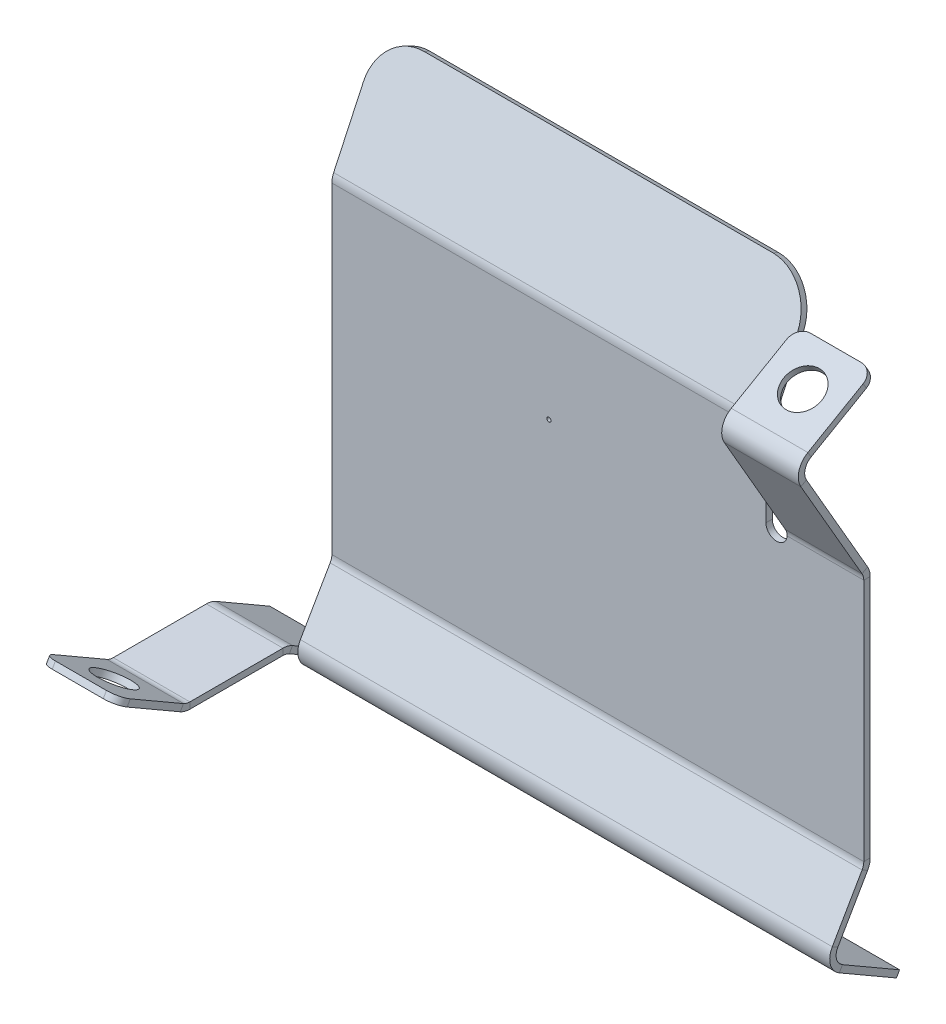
ISO-10303-21;
HEADER;
FILE_DESCRIPTION(('STEP AP214'),'2;1');
FILE_NAME('part.step','',(''),(''),'','','');
FILE_SCHEMA(('AUTOMOTIVE_DESIGN { 1 0 10303 214 1 1 1 1 }'));
ENDSEC;
DATA;
#1=APPLICATION_CONTEXT('core data for automotive mechanical design processes');
#2=APPLICATION_PROTOCOL_DEFINITION('international standard','automotive_design',2000,#1);
#3=PRODUCT_CONTEXT('',#1,'mechanical');
#4=PRODUCT('Part','Part','',(#3));
#5=PRODUCT_RELATED_PRODUCT_CATEGORY('part','',(#4));
#6=PRODUCT_DEFINITION_FORMATION('','',#4);
#7=PRODUCT_DEFINITION_CONTEXT('part definition',#1,'design');
#8=PRODUCT_DEFINITION('design','',#6,#7);
#9=PRODUCT_DEFINITION_SHAPE('','',#8);
#10=(LENGTH_UNIT() NAMED_UNIT(*) SI_UNIT(.MILLI.,.METRE.));
#11=(NAMED_UNIT(*) PLANE_ANGLE_UNIT() SI_UNIT($,.RADIAN.));
#12=(NAMED_UNIT(*) SI_UNIT($,.STERADIAN.) SOLID_ANGLE_UNIT());
#13=UNCERTAINTY_MEASURE_WITH_UNIT(LENGTH_MEASURE(1.E-05),#10,'distance_accuracy_value','');
#14=(GEOMETRIC_REPRESENTATION_CONTEXT(3) GLOBAL_UNCERTAINTY_ASSIGNED_CONTEXT((#13)) GLOBAL_UNIT_ASSIGNED_CONTEXT((#10,
#11,#12)) REPRESENTATION_CONTEXT('',''));
#15=CARTESIAN_POINT('',(0.,0.,0.));
#16=DIRECTION('',(0.,0.,1.));
#17=DIRECTION('',(1.,0.,0.));
#18=AXIS2_PLACEMENT_3D('',#15,#16,#17);
#19=CARTESIAN_POINT('',(-71.,-87.1281308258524,-108.408615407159));
#20=DIRECTION('',(0.,1.,0.));
#21=DIRECTION('',(-1.,0.,0.));
#22=AXIS2_PLACEMENT_3D('',#19,#20,#21);
#23=PLANE('',#22);
#24=DIRECTION('',(0.,0.,-1.));
#25=VECTOR('',#24,1.);
#26=CARTESIAN_POINT('',(-74.,-87.1281308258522,-163.106615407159));
#27=LINE('',#26,#25);
#28=CARTESIAN_POINT('',(-74.,-87.1281308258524,-124.731457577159));
#29=VERTEX_POINT('',#28);
#30=CARTESIAN_POINT('',(-74.,-87.1281307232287,-146.606615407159));
#31=VERTEX_POINT('',#30);
#32=EDGE_CURVE('E87',#29,#31,#27,.T.);
#33=ORIENTED_EDGE('',*,*,#32,.F.);
#34=DIRECTION('',(1.,0.,0.));
#35=VECTOR('',#34,1.);
#36=CARTESIAN_POINT('',(-71.,-87.1281308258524,-124.731457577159));
#37=LINE('',#36,#35);
#38=CARTESIAN_POINT('',(-56.,-87.1281308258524,-124.731457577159));
#39=VERTEX_POINT('',#38);
#40=EDGE_CURVE('E79',#29,#39,#37,.T.);
#41=ORIENTED_EDGE('',*,*,#40,.T.);
#42=DIRECTION('',(0.,0.,1.));
#43=VECTOR('',#42,1.);
#44=CARTESIAN_POINT('',(-56.,-87.1281308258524,-108.408615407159));
#45=LINE('',#44,#43);
#46=CARTESIAN_POINT('',(-56.,-87.1281308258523,-146.606615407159));
#47=VERTEX_POINT('',#46);
#48=EDGE_CURVE('E95',#47,#39,#45,.T.);
#49=ORIENTED_EDGE('',*,*,#48,.F.);
#50=DIRECTION('',(1.,0.,0.));
#51=VECTOR('',#50,1.);
#52=CARTESIAN_POINT('',(-71.,-87.1281308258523,-146.606615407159));
#53=LINE('',#52,#51);
#54=EDGE_CURVE('E432',#31,#47,#53,.T.);
#55=ORIENTED_EDGE('',*,*,#54,.F.);
#56=EDGE_LOOP('',(#33,#41,#49,#55));
#57=FACE_BOUND('',#56,.T.);
#58=ADVANCED_FACE('F70',(#57),#23,.T.);
#59=CARTESIAN_POINT('',(-71.,-67.6894375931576,-114.143582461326));
#60=DIRECTION('',(0.,0.86602540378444,-0.499999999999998));
#61=DIRECTION('',(-1.,0.,0.));
#62=AXIS2_PLACEMENT_3D('',#59,#60,#61);
#63=PLANE('',#62);
#64=DIRECTION('',(0.,-0.499999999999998,-0.86602540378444));
#65=VECTOR('',#64,1.);
#66=CARTESIAN_POINT('',(-74.,-95.0384375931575,-161.513439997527));
#67=LINE('',#66,#65);
#68=CARTESIAN_POINT('',(-74.,-87.7310165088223,-148.856615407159));
#69=VERTEX_POINT('',#68);
#70=CARTESIAN_POINT('',(-74.,-95.0384375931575,-161.513439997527));
#71=VERTEX_POINT('',#70);
#72=EDGE_CURVE('E755',#69,#71,#67,.T.);
#73=ORIENTED_EDGE('',*,*,#72,.F.);
#74=DIRECTION('',(1.,0.,0.));
#75=VECTOR('',#74,1.);
#76=CARTESIAN_POINT('',(-71.,-87.7310165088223,-148.856615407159));
#77=LINE('',#76,#75);
#78=CARTESIAN_POINT('',(-56.,-87.7310165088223,-148.856615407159));
#79=VERTEX_POINT('',#78);
#80=EDGE_CURVE('E1151',#69,#79,#77,.T.);
#81=ORIENTED_EDGE('',*,*,#80,.T.);
#82=DIRECTION('',(0.,0.499999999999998,0.86602540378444));
#83=VECTOR('',#82,1.);
#84=CARTESIAN_POINT('',(-56.,-67.6894375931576,-114.143582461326));
#85=LINE('',#84,#83);
#86=CARTESIAN_POINT('',(-56.,-88.7884375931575,-150.688122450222));
#87=VERTEX_POINT('',#86);
#88=EDGE_CURVE('E751',#87,#79,#85,.T.);
#89=ORIENTED_EDGE('',*,*,#88,.F.);
#90=CARTESIAN_POINT('',(-53.5,-88.7884375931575,-150.688122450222));
#91=DIRECTION('',(0.,0.86602540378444,-0.499999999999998));
#92=DIRECTION('',(1.,0.,0.));
#93=AXIS2_PLACEMENT_3D('',#90,#91,#92);
#94=CIRCLE('',#93,2.5);
#95=CARTESIAN_POINT('',(-51.,-88.7884375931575,-150.688122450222));
#96=VERTEX_POINT('',#95);
#97=EDGE_CURVE('E746',#96,#87,#94,.T.);
#98=ORIENTED_EDGE('',*,*,#97,.F.);
#99=DIRECTION('',(0.,-0.499999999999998,-0.86602540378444));
#100=VECTOR('',#99,1.);
#101=CARTESIAN_POINT('',(-51.,-88.7884375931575,-150.688122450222));
#102=LINE('',#101,#100);
#103=CARTESIAN_POINT('',(-51.,-87.2884375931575,-148.090046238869));
#104=VERTEX_POINT('',#103);
#105=EDGE_CURVE('E730',#104,#96,#102,.T.);
#106=ORIENTED_EDGE('',*,*,#105,.F.);
#107=DIRECTION('',(1.,0.,0.));
#108=VECTOR('',#107,1.);
#109=CARTESIAN_POINT('',(-71.,-87.2884375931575,-148.090046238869));
#110=LINE('',#109,#108);
#111=CARTESIAN_POINT('',(74.,-87.2884375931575,-148.090046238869));
#112=VERTEX_POINT('',#111);
#113=EDGE_CURVE('E727',#104,#112,#110,.T.);
#114=ORIENTED_EDGE('',*,*,#113,.T.);
#115=DIRECTION('',(0.,0.499999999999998,0.86602540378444));
#116=VECTOR('',#115,1.);
#117=CARTESIAN_POINT('',(74.,-22.2279375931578,-35.4019546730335));
#118=LINE('',#117,#116);
#119=CARTESIAN_POINT('',(74.,-95.0384375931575,-161.513439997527));
#120=VERTEX_POINT('',#119);
#121=EDGE_CURVE('E721',#120,#112,#118,.T.);
#122=ORIENTED_EDGE('',*,*,#121,.F.);
#123=DIRECTION('',(1.,0.,0.));
#124=VECTOR('',#123,1.);
#125=CARTESIAN_POINT('',(74.,-95.0384375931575,-161.513439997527));
#126=LINE('',#125,#124);
#127=EDGE_CURVE('E756',#71,#120,#126,.T.);
#128=ORIENTED_EDGE('',*,*,#127,.F.);
#129=EDGE_LOOP('',(#73,#81,#89,#98,#106,#114,#122,#128));
#130=FACE_BOUND('',#129,.T.);
#131=ADVANCED_FACE('F877',(#130),#63,.T.);
#132=CARTESIAN_POINT('',(-71.,-45.2341030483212,-174.74102243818));
#133=DIRECTION('',(0.,0.500000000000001,-0.866025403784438));
#134=DIRECTION('',(-1.,0.,0.));
#135=AXIS2_PLACEMENT_3D('',#132,#133,#134);
#136=PLANE('',#135);
#137=DIRECTION('',(0.,-0.866025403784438,-0.500000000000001));
#138=VECTOR('',#137,1.);
#139=CARTESIAN_POINT('',(56.,-10.764559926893,-154.84002243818));
#140=LINE('',#139,#138);
#141=CARTESIAN_POINT('',(56.,15.6201341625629,-139.606812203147));
#142=VERTEX_POINT('',#141);
#143=CARTESIAN_POINT('',(56.,-9.29569006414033,-153.991970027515));
#144=VERTEX_POINT('',#143);
#145=EDGE_CURVE('E511',#142,#144,#140,.T.);
#146=ORIENTED_EDGE('',*,*,#145,.F.);
#147=DIRECTION('',(1.,0.,0.));
#148=VECTOR('',#147,1.);
#149=CARTESIAN_POINT('',(-71.,15.6201341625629,-139.606812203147));
#150=LINE('',#149,#148);
#151=CARTESIAN_POINT('',(74.,15.6201341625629,-139.606812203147));
#152=VERTEX_POINT('',#151);
#153=EDGE_CURVE('E1112',#142,#152,#150,.T.);
#154=ORIENTED_EDGE('',*,*,#153,.T.);
#155=DIRECTION('',(0.,0.866025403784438,0.500000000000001));
#156=VECTOR('',#155,1.);
#157=CARTESIAN_POINT('',(74.,33.5075247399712,-129.27952243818));
#158=LINE('',#157,#156);
#159=CARTESIAN_POINT('',(74.,-9.29569006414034,-153.991970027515));
#160=VERTEX_POINT('',#159);
#161=EDGE_CURVE('E515',#160,#152,#158,.T.);
#162=ORIENTED_EDGE('',*,*,#161,.F.);
#163=DIRECTION('',(1.,0.,0.));
#164=VECTOR('',#163,1.);
#165=CARTESIAN_POINT('',(-71.,-9.29569006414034,-153.991970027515));
#166=LINE('',#165,#164);
#167=EDGE_CURVE('E458',#144,#160,#166,.T.);
#168=ORIENTED_EDGE('',*,*,#167,.F.);
#169=EDGE_LOOP('',(#146,#154,#162,#168));
#170=FACE_BOUND('',#169,.T.);
#171=ADVANCED_FACE('F864',(#170),#136,.T.);
#172=CARTESIAN_POINT('',(-71.,-51.1586370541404,-154.594855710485));
#173=DIRECTION('',(0.,0.,-1.));
#174=DIRECTION('',(-1.,0.,0.));
#175=AXIS2_PLACEMENT_3D('',#172,#173,#174);
#176=PLANE('',#175);
#177=CARTESIAN_POINT('',(0.,-15.8566370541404,-154.594855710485));
#178=DIRECTION('',(0.,0.,1.));
#179=DIRECTION('',(1.,0.,0.));
#180=AXIS2_PLACEMENT_3D('',#177,#178,#179);
#181=CIRCLE('',#180,0.5);
#182=CARTESIAN_POINT('',(0.499999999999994,-15.8566370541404,-154.594855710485));
#183=VERTEX_POINT('',#182);
#184=EDGE_CURVE('E676',#183,#183,#181,.T.);
#185=ORIENTED_EDGE('',*,*,#184,.T.);
#186=EDGE_LOOP('',(#185));
#187=FACE_BOUND('',#186,.T.);
#188=CARTESIAN_POINT('',(53.5,-11.3566370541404,-154.594855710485));
#189=DIRECTION('',(0.,0.,-1.));
#190=DIRECTION('',(1.,0.,0.));
#191=AXIS2_PLACEMENT_3D('',#188,#189,#190);
#192=CIRCLE('',#191,2.5);
#193=CARTESIAN_POINT('',(55.9928415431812,-11.5456900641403,-154.594855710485));
#194=VERTEX_POINT('',#193);
#195=CARTESIAN_POINT('',(51.,-11.3566370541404,-154.594855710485));
#196=VERTEX_POINT('',#195);
#197=EDGE_CURVE('E691',#194,#196,#192,.T.);
#198=ORIENTED_EDGE('',*,*,#197,.F.);
#199=DIRECTION('',(1.,0.,0.));
#200=VECTOR('',#199,1.);
#201=CARTESIAN_POINT('',(-71.,-11.5456900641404,-154.594855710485));
#202=LINE('',#201,#200);
#203=CARTESIAN_POINT('',(74.,-11.5456900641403,-154.594855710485));
#204=VERTEX_POINT('',#203);
#205=EDGE_CURVE('E818',#194,#204,#202,.T.);
#206=ORIENTED_EDGE('',*,*,#205,.T.);
#207=DIRECTION('',(0.,1.,0.));
#208=VECTOR('',#207,1.);
#209=CARTESIAN_POINT('',(74.,39.7643629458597,-154.594855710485));
#210=LINE('',#209,#208);
#211=CARTESIAN_POINT('',(74.,-68.8160057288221,-154.594855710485));
#212=VERTEX_POINT('',#211);
#213=EDGE_CURVE('E679',#212,#204,#210,.T.);
#214=ORIENTED_EDGE('',*,*,#213,.F.);
#215=DIRECTION('',(1.,0.,0.));
#216=VECTOR('',#215,1.);
#217=CARTESIAN_POINT('',(-71.,-68.8160057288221,-154.594855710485));
#218=LINE('',#217,#216);
#219=CARTESIAN_POINT('',(-51.,-68.8160057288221,-154.594855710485));
#220=VERTEX_POINT('',#219);
#221=EDGE_CURVE('E670',#220,#212,#218,.T.);
#222=ORIENTED_EDGE('',*,*,#221,.F.);
#223=DIRECTION('',(0.,-1.,0.));
#224=VECTOR('',#223,1.);
#225=CARTESIAN_POINT('',(-51.,-93.3566370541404,-154.594855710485));
#226=LINE('',#225,#224);
#227=CARTESIAN_POINT('',(-51.,6.79656240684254,-154.594855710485));
#228=VERTEX_POINT('',#227);
#229=EDGE_CURVE('E675',#228,#220,#226,.T.);
#230=ORIENTED_EDGE('',*,*,#229,.F.);
#231=DIRECTION('',(1.,0.,0.));
#232=VECTOR('',#231,1.);
#233=CARTESIAN_POINT('',(-71.,6.79656240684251,-154.594855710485));
#234=LINE('',#233,#232);
#235=CARTESIAN_POINT('',(51.,6.79656240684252,-154.594855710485));
#236=VERTEX_POINT('',#235);
#237=EDGE_CURVE('E803',#228,#236,#234,.T.);
#238=ORIENTED_EDGE('',*,*,#237,.T.);
#239=DIRECTION('',(0.,1.,0.));
#240=VECTOR('',#239,1.);
#241=CARTESIAN_POINT('',(51.,24.9133629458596,-154.594855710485));
#242=LINE('',#241,#240);
#243=EDGE_CURVE('E695',#196,#236,#242,.T.);
#244=ORIENTED_EDGE('',*,*,#243,.F.);
#245=EDGE_LOOP('',(#198,#206,#214,#222,#230,#238,#244));
#246=FACE_BOUND('',#245,.T.);
#247=ADVANCED_FACE('F860',(#187,#246),#176,.T.);
#248=CARTESIAN_POINT('',(-71.,-54.1416813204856,-163.763233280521));
#249=DIRECTION('',(0.,-0.500000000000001,-0.866025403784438));
#250=DIRECTION('',(-1.,0.,0.));
#251=AXIS2_PLACEMENT_3D('',#248,#249,#250);
#252=PLANE('',#251);
#253=DIRECTION('',(0.,-0.866025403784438,0.500000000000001));
#254=VECTOR('',#253,1.);
#255=CARTESIAN_POINT('',(-51.,-90.6862213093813,-142.664233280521));
#256=LINE('',#255,#254);
#257=CARTESIAN_POINT('',(-51.,-71.0660057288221,-153.991970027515));
#258=VERTEX_POINT('',#257);
#259=CARTESIAN_POINT('',(-51.,-83.1903614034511,-146.991970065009));
#260=VERTEX_POINT('',#259);
#261=EDGE_CURVE('E792',#258,#260,#256,.T.);
#262=ORIENTED_EDGE('',*,*,#261,.F.);
#263=DIRECTION('',(1.,0.,0.));
#264=VECTOR('',#263,1.);
#265=CARTESIAN_POINT('',(-71.,-71.0660057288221,-153.991970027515));
#266=LINE('',#265,#264);
#267=CARTESIAN_POINT('',(74.,-71.0660057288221,-153.991970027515));
#268=VERTEX_POINT('',#267);
#269=EDGE_CURVE('E785',#258,#268,#266,.T.);
#270=ORIENTED_EDGE('',*,*,#269,.T.);
#271=DIRECTION('',(0.,0.866025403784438,-0.500000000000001));
#272=VECTOR('',#271,1.);
#273=CARTESIAN_POINT('',(74.,24.5999464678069,-209.224733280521));
#274=LINE('',#273,#272);
#275=CARTESIAN_POINT('',(74.,-83.1903614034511,-146.991970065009));
#276=VERTEX_POINT('',#275);
#277=EDGE_CURVE('E723',#276,#268,#274,.T.);
#278=ORIENTED_EDGE('',*,*,#277,.F.);
#279=DIRECTION('',(1.,0.,0.));
#280=VECTOR('',#279,1.);
#281=CARTESIAN_POINT('',(-71.,-83.1903613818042,-146.991970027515));
#282=LINE('',#281,#280);
#283=EDGE_CURVE('E774',#260,#276,#282,.T.);
#284=ORIENTED_EDGE('',*,*,#283,.F.);
#285=EDGE_LOOP('',(#262,#270,#278,#284));
#286=FACE_BOUND('',#285,.T.);
#287=ADVANCED_FACE('F863',(#286),#252,.T.);
#288=CARTESIAN_POINT('',(-71.,-53.3916813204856,-162.464195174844));
#289=DIRECTION('',(0.,-0.500000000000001,-0.866025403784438));
#290=DIRECTION('',(-1.,0.,0.));
#291=AXIS2_PLACEMENT_3D('',#288,#289,#290);
#292=PLANE('',#291);
#293=DIRECTION('',(1.,0.,0.));
#294=VECTOR('',#293,1.);
#295=CARTESIAN_POINT('',(-71.,-70.3160057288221,-152.692931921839));
#296=LINE('',#295,#294);
#297=CARTESIAN_POINT('',(-51.,-70.3160057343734,-152.692931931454));
#298=VERTEX_POINT('',#297);
#299=CARTESIAN_POINT('',(74.,-70.3160057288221,-152.692931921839));
#300=VERTEX_POINT('',#299);
#301=EDGE_CURVE('E779',#298,#300,#296,.T.);
#302=ORIENTED_EDGE('',*,*,#301,.F.);
#303=DIRECTION('',(0.,-0.866025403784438,0.500000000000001));
#304=VECTOR('',#303,1.);
#305=CARTESIAN_POINT('',(-51.,-89.9362213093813,-141.365195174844));
#306=LINE('',#305,#304);
#307=CARTESIAN_POINT('',(-51.,-82.4403614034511,-145.692931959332));
#308=VERTEX_POINT('',#307);
#309=EDGE_CURVE('E771',#298,#308,#306,.T.);
#310=ORIENTED_EDGE('',*,*,#309,.T.);
#311=DIRECTION('',(1.,0.,0.));
#312=VECTOR('',#311,1.);
#313=CARTESIAN_POINT('',(-71.,-82.4403613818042,-145.692931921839));
#314=LINE('',#313,#312);
#315=CARTESIAN_POINT('',(74.,-82.4403613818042,-145.692931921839));
#316=VERTEX_POINT('',#315);
#317=EDGE_CURVE('E767',#308,#316,#314,.T.);
#318=ORIENTED_EDGE('',*,*,#317,.T.);
#319=DIRECTION('',(0.,0.866025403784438,-0.500000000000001));
#320=VECTOR('',#319,1.);
#321=CARTESIAN_POINT('',(74.,25.3499464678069,-207.925695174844));
#322=LINE('',#321,#320);
#323=EDGE_CURVE('E794',#316,#300,#322,.T.);
#324=ORIENTED_EDGE('',*,*,#323,.T.);
#325=EDGE_LOOP('',(#302,#310,#318,#324));
#326=FACE_BOUND('',#325,.T.);
#327=ADVANCED_FACE('F1269',(#326),#292,.F.);
#328=CARTESIAN_POINT('',(74.,25.3499464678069,-207.925695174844));
#329=DIRECTION('',(-1.,0.,0.));
#330=DIRECTION('',(0.,-0.866025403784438,0.500000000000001));
#331=AXIS2_PLACEMENT_3D('',#328,#329,#330);
#332=PLANE('',#331);
#333=DIRECTION('',(0.,-0.500000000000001,-0.866025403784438));
#334=VECTOR('',#333,1.);
#335=CARTESIAN_POINT('',(74.,-70.3160057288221,-152.692931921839));
#336=LINE('',#335,#334);
#337=EDGE_CURVE('E782',#300,#268,#336,.T.);
#338=ORIENTED_EDGE('',*,*,#337,.F.);
#339=ORIENTED_EDGE('',*,*,#323,.F.);
#340=DIRECTION('',(0.,-0.500000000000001,-0.866025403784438));
#341=VECTOR('',#340,1.);
#342=CARTESIAN_POINT('',(74.,-82.4403613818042,-145.692931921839));
#343=LINE('',#342,#341);
#344=EDGE_CURVE('E776',#316,#276,#343,.T.);
#345=ORIENTED_EDGE('',*,*,#344,.T.);
#346=ORIENTED_EDGE('',*,*,#277,.T.);
#347=EDGE_LOOP('',(#338,#339,#345,#346));
#348=FACE_BOUND('',#347,.T.);
#349=ADVANCED_FACE('F1258',(#348),#332,.F.);
#350=CARTESIAN_POINT('',(-51.,-89.9362213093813,-141.365195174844));
#351=DIRECTION('',(1.,0.,0.));
#352=DIRECTION('',(0.,0.866025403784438,-0.500000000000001));
#353=AXIS2_PLACEMENT_3D('',#350,#351,#352);
#354=PLANE('',#353);
#355=DIRECTION('',(0.,0.500000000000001,0.866025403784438));
#356=VECTOR('',#355,1.);
#357=CARTESIAN_POINT('',(-51.,-70.3160057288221,-152.692931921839));
#358=LINE('',#357,#356);
#359=EDGE_CURVE('E788',#258,#298,#358,.T.);
#360=ORIENTED_EDGE('',*,*,#359,.F.);
#361=ORIENTED_EDGE('',*,*,#261,.T.);
#362=DIRECTION('',(0.,0.500000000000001,0.866025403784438));
#363=VECTOR('',#362,1.);
#364=CARTESIAN_POINT('',(-51.,-82.4403613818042,-145.692931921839));
#365=LINE('',#364,#363);
#366=EDGE_CURVE('E770',#260,#308,#365,.T.);
#367=ORIENTED_EDGE('',*,*,#366,.T.);
#368=ORIENTED_EDGE('',*,*,#309,.F.);
#369=EDGE_LOOP('',(#360,#361,#367,#368));
#370=FACE_BOUND('',#369,.T.);
#371=ADVANCED_FACE('F1236',(#370),#354,.F.);
#372=CARTESIAN_POINT('',(74.,-96.3374756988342,-160.763439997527));
#373=DIRECTION('',(0.,0.499999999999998,0.86602540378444));
#374=DIRECTION('',(-1.,0.,0.));
#375=AXIS2_PLACEMENT_3D('',#372,#373,#374);
#376=PLANE('',#375);
#377=ORIENTED_EDGE('',*,*,#127,.T.);
#378=DIRECTION('',(0.,0.86602540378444,-0.499999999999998));
#379=VECTOR('',#378,1.);
#380=CARTESIAN_POINT('',(74.,-96.3374756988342,-160.763439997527));
#381=LINE('',#380,#379);
#382=CARTESIAN_POINT('',(74.,-96.3374756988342,-160.763439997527));
#383=VERTEX_POINT('',#382);
#384=EDGE_CURVE('E724',#383,#120,#381,.T.);
#385=ORIENTED_EDGE('',*,*,#384,.F.);
#386=DIRECTION('',(1.,0.,0.));
#387=VECTOR('',#386,1.);
#388=CARTESIAN_POINT('',(74.,-96.3374756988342,-160.763439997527));
#389=LINE('',#388,#387);
#390=CARTESIAN_POINT('',(-74.,-96.3374756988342,-160.763439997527));
#391=VERTEX_POINT('',#390);
#392=EDGE_CURVE('E734',#391,#383,#389,.T.);
#393=ORIENTED_EDGE('',*,*,#392,.F.);
#394=DIRECTION('',(0.,0.86602540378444,-0.499999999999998));
#395=VECTOR('',#394,1.);
#396=CARTESIAN_POINT('',(-74.,-96.3374756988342,-160.763439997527));
#397=LINE('',#396,#395);
#398=EDGE_CURVE('E752',#391,#71,#397,.T.);
#399=ORIENTED_EDGE('',*,*,#398,.T.);
#400=EDGE_LOOP('',(#377,#385,#393,#399));
#401=FACE_BOUND('',#400,.T.);
#402=ADVANCED_FACE('F899',(#401),#376,.F.);
#403=CARTESIAN_POINT('',(-74.,-96.3374756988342,-160.763439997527));
#404=DIRECTION('',(1.,0.,0.));
#405=DIRECTION('',(0.,0.499999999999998,0.86602540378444));
#406=AXIS2_PLACEMENT_3D('',#403,#404,#405);
#407=PLANE('',#406);
#408=DIRECTION('',(0.,-0.86602540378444,0.499999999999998));
#409=VECTOR('',#408,1.);
#410=CARTESIAN_POINT('',(-74.,-89.030054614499,-148.106615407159));
#411=LINE('',#410,#409);
#412=CARTESIAN_POINT('',(-74.,-89.030054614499,-148.106615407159));
#413=VERTEX_POINT('',#412);
#414=EDGE_CURVE('E1154',#69,#413,#411,.T.);
#415=ORIENTED_EDGE('',*,*,#414,.F.);
#416=ORIENTED_EDGE('',*,*,#72,.T.);
#417=ORIENTED_EDGE('',*,*,#398,.F.);
#418=DIRECTION('',(0.,-0.499999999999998,-0.86602540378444));
#419=VECTOR('',#418,1.);
#420=CARTESIAN_POINT('',(-74.,-96.3374756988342,-160.763439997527));
#421=LINE('',#420,#419);
#422=EDGE_CURVE('E737',#413,#391,#421,.T.);
#423=ORIENTED_EDGE('',*,*,#422,.F.);
#424=EDGE_LOOP('',(#415,#416,#417,#423));
#425=FACE_BOUND('',#424,.T.);
#426=ADVANCED_FACE('F892',(#425),#407,.F.);
#427=CARTESIAN_POINT('',(-56.,-68.9884756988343,-113.393582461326));
#428=DIRECTION('',(-1.,0.,0.));
#429=DIRECTION('',(0.,-0.499999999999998,-0.86602540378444));
#430=AXIS2_PLACEMENT_3D('',#427,#428,#429);
#431=PLANE('',#430);
#432=DIRECTION('',(0.,0.86602540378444,-0.499999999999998));
#433=VECTOR('',#432,1.);
#434=CARTESIAN_POINT('',(-56.,-89.030054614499,-148.106615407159));
#435=LINE('',#434,#433);
#436=CARTESIAN_POINT('',(-56.,-89.0300545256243,-148.106615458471));
#437=VERTEX_POINT('',#436);
#438=EDGE_CURVE('E1148',#437,#79,#435,.T.);
#439=ORIENTED_EDGE('',*,*,#438,.F.);
#440=DIRECTION('',(0.,0.499999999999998,0.86602540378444));
#441=VECTOR('',#440,1.);
#442=CARTESIAN_POINT('',(-56.,-68.9884756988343,-113.393582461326));
#443=LINE('',#442,#441);
#444=CARTESIAN_POINT('',(-56.,-90.0874756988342,-149.938122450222));
#445=VERTEX_POINT('',#444);
#446=EDGE_CURVE('E740',#445,#437,#443,.T.);
#447=ORIENTED_EDGE('',*,*,#446,.F.);
#448=DIRECTION('',(0.,0.86602540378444,-0.499999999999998));
#449=VECTOR('',#448,1.);
#450=CARTESIAN_POINT('',(-56.,-90.0874756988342,-149.938122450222));
#451=LINE('',#450,#449);
#452=EDGE_CURVE('E748',#445,#87,#451,.T.);
#453=ORIENTED_EDGE('',*,*,#452,.T.);
#454=ORIENTED_EDGE('',*,*,#88,.T.);
#455=EDGE_LOOP('',(#439,#447,#453,#454));
#456=FACE_BOUND('',#455,.T.);
#457=ADVANCED_FACE('F889',(#456),#431,.F.);
#458=CARTESIAN_POINT('',(-53.5,-90.0874756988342,-149.938122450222));
#459=DIRECTION('',(0.,0.86602540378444,-0.499999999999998));
#460=DIRECTION('',(-1.,0.,0.));
#461=AXIS2_PLACEMENT_3D('',#458,#459,#460);
#462=CYLINDRICAL_SURFACE('',#461,2.5);
#463=ORIENTED_EDGE('',*,*,#97,.T.);
#464=ORIENTED_EDGE('',*,*,#452,.F.);
#465=CARTESIAN_POINT('',(-53.5,-90.0874756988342,-149.938122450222));
#466=DIRECTION('',(0.,0.86602540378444,-0.499999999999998));
#467=DIRECTION('',(1.,0.,0.));
#468=AXIS2_PLACEMENT_3D('',#465,#466,#467);
#469=CIRCLE('',#468,2.5);
#470=CARTESIAN_POINT('',(-51.,-90.0874756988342,-149.938122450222));
#471=VERTEX_POINT('',#470);
#472=EDGE_CURVE('E738',#471,#445,#469,.T.);
#473=ORIENTED_EDGE('',*,*,#472,.F.);
#474=DIRECTION('',(0.,0.86602540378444,-0.499999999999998));
#475=VECTOR('',#474,1.);
#476=CARTESIAN_POINT('',(-51.,-90.0874756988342,-149.938122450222));
#477=LINE('',#476,#475);
#478=EDGE_CURVE('E743',#471,#96,#477,.T.);
#479=ORIENTED_EDGE('',*,*,#478,.T.);
#480=EDGE_LOOP('',(#463,#464,#473,#479));
#481=FACE_BOUND('',#480,.T.);
#482=ADVANCED_FACE('F887',(#481),#462,.F.);
#483=CARTESIAN_POINT('',(-71.,-68.9884756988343,-113.393582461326));
#484=DIRECTION('',(0.,0.86602540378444,-0.499999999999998));
#485=DIRECTION('',(-1.,0.,0.));
#486=AXIS2_PLACEMENT_3D('',#483,#484,#485);
#487=PLANE('',#486);
#488=DIRECTION('',(1.,0.,0.));
#489=VECTOR('',#488,1.);
#490=CARTESIAN_POINT('',(-71.,-89.030054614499,-148.106615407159));
#491=LINE('',#490,#489);
#492=EDGE_CURVE('E1141',#413,#437,#491,.T.);
#493=ORIENTED_EDGE('',*,*,#492,.F.);
#494=ORIENTED_EDGE('',*,*,#422,.T.);
#495=ORIENTED_EDGE('',*,*,#392,.T.);
#496=DIRECTION('',(0.,0.499999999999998,0.86602540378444));
#497=VECTOR('',#496,1.);
#498=CARTESIAN_POINT('',(74.,-23.5269756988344,-34.6519546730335));
#499=LINE('',#498,#497);
#500=CARTESIAN_POINT('',(74.,-88.5874756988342,-147.340046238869));
#501=VERTEX_POINT('',#500);
#502=EDGE_CURVE('E732',#383,#501,#499,.T.);
#503=ORIENTED_EDGE('',*,*,#502,.T.);
#504=DIRECTION('',(1.,0.,0.));
#505=VECTOR('',#504,1.);
#506=CARTESIAN_POINT('',(-71.,-88.5874756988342,-147.340046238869));
#507=LINE('',#506,#505);
#508=CARTESIAN_POINT('',(-51.,-88.5874756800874,-147.340046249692));
#509=VERTEX_POINT('',#508);
#510=EDGE_CURVE('E720',#509,#501,#507,.T.);
#511=ORIENTED_EDGE('',*,*,#510,.F.);
#512=DIRECTION('',(0.,-0.499999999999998,-0.86602540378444));
#513=VECTOR('',#512,1.);
#514=CARTESIAN_POINT('',(-51.,-90.0874756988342,-149.938122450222));
#515=LINE('',#514,#513);
#516=EDGE_CURVE('E741',#509,#471,#515,.T.);
#517=ORIENTED_EDGE('',*,*,#516,.T.);
#518=ORIENTED_EDGE('',*,*,#472,.T.);
#519=ORIENTED_EDGE('',*,*,#446,.T.);
#520=EDGE_LOOP('',(#493,#494,#495,#503,#511,#517,#518,#519));
#521=FACE_BOUND('',#520,.T.);
#522=ADVANCED_FACE('F883',(#521),#487,.F.);
#523=CARTESIAN_POINT('',(-51.,-90.0874756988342,-149.938122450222));
#524=DIRECTION('',(1.,0.,0.));
#525=DIRECTION('',(0.,0.499999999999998,0.86602540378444));
#526=AXIS2_PLACEMENT_3D('',#523,#524,#525);
#527=PLANE('',#526);
#528=DIRECTION('',(0.,-0.86602540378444,0.499999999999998));
#529=VECTOR('',#528,1.);
#530=CARTESIAN_POINT('',(-51.,-88.5874756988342,-147.340046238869));
#531=LINE('',#530,#529);
#532=EDGE_CURVE('E759',#104,#509,#531,.T.);
#533=ORIENTED_EDGE('',*,*,#532,.F.);
#534=ORIENTED_EDGE('',*,*,#105,.T.);
#535=ORIENTED_EDGE('',*,*,#478,.F.);
#536=ORIENTED_EDGE('',*,*,#516,.F.);
#537=EDGE_LOOP('',(#533,#534,#535,#536));
#538=FACE_BOUND('',#537,.T.);
#539=ADVANCED_FACE('F886',(#538),#527,.F.);
#540=CARTESIAN_POINT('',(74.,-23.5269756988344,-34.6519546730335));
#541=DIRECTION('',(-1.,0.,0.));
#542=DIRECTION('',(0.,-0.499999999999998,-0.86602540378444));
#543=AXIS2_PLACEMENT_3D('',#540,#541,#542);
#544=PLANE('',#543);
#545=DIRECTION('',(0.,0.86602540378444,-0.499999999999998));
#546=VECTOR('',#545,1.);
#547=CARTESIAN_POINT('',(74.,-88.5874756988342,-147.340046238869));
#548=LINE('',#547,#546);
#549=EDGE_CURVE('E762',#501,#112,#548,.T.);
#550=ORIENTED_EDGE('',*,*,#549,.F.);
#551=ORIENTED_EDGE('',*,*,#502,.F.);
#552=ORIENTED_EDGE('',*,*,#384,.T.);
#553=ORIENTED_EDGE('',*,*,#121,.T.);
#554=EDGE_LOOP('',(#550,#551,#552,#553));
#555=FACE_BOUND('',#554,.T.);
#556=ADVANCED_FACE('F1247',(#555),#544,.F.);
#557=CARTESIAN_POINT('',(-51.,-84.6903614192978,-149.590046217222));
#558=DIRECTION('',(-1.,0.,0.));
#559=DIRECTION('',(0.,-0.86602540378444,0.499999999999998));
#560=AXIS2_PLACEMENT_3D('',#557,#558,#559);
#561=PLANE('',#560);
#562=ORIENTED_EDGE('',*,*,#366,.F.);
#563=CARTESIAN_POINT('',(-51.,-84.6903613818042,-149.590046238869));
#564=DIRECTION('',(-1.,0.,0.));
#565=DIRECTION('',(0.,-0.499999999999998,-0.86602540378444));
#566=AXIS2_PLACEMENT_3D('',#563,#564,#565);
#567=CIRCLE('',#566,2.99999995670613);
#568=EDGE_CURVE('E709',#260,#104,#567,.F.);
#569=ORIENTED_EDGE('',*,*,#568,.T.);
#570=ORIENTED_EDGE('',*,*,#532,.T.);
#571=CARTESIAN_POINT('',(-51.,-84.6903614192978,-149.590046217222));
#572=DIRECTION('',(1.,0.,0.));
#573=DIRECTION('',(0.,0.86602540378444,-0.499999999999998));
#574=AXIS2_PLACEMENT_3D('',#571,#572,#573);
#575=CIRCLE('',#574,4.49999993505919);
#576=EDGE_CURVE('E715',#308,#509,#575,.T.);
#577=ORIENTED_EDGE('',*,*,#576,.F.);
#578=EDGE_LOOP('',(#562,#569,#570,#577));
#579=FACE_BOUND('',#578,.T.);
#580=ADVANCED_FACE('F1233',(#579),#561,.T.);
#581=CARTESIAN_POINT('',(74.,-84.6903614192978,-149.590046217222));
#582=DIRECTION('',(1.,0.,0.));
#583=DIRECTION('',(0.,0.86602540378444,-0.499999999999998));
#584=AXIS2_PLACEMENT_3D('',#581,#582,#583);
#585=PLANE('',#584);
#586=CARTESIAN_POINT('',(74.,-84.6903613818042,-149.590046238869));
#587=DIRECTION('',(-1.,0.,0.));
#588=DIRECTION('',(0.,-0.499999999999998,-0.86602540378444));
#589=AXIS2_PLACEMENT_3D('',#586,#587,#588);
#590=CIRCLE('',#589,2.99999995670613);
#591=EDGE_CURVE('E712',#112,#276,#590,.T.);
#592=ORIENTED_EDGE('',*,*,#591,.T.);
#593=ORIENTED_EDGE('',*,*,#344,.F.);
#594=CARTESIAN_POINT('',(74.,-84.6903614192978,-149.590046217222));
#595=DIRECTION('',(-1.,0.,0.));
#596=DIRECTION('',(0.,-0.86602540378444,0.499999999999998));
#597=AXIS2_PLACEMENT_3D('',#594,#595,#596);
#598=CIRCLE('',#597,4.49999993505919);
#599=EDGE_CURVE('E718',#501,#316,#598,.T.);
#600=ORIENTED_EDGE('',*,*,#599,.F.);
#601=ORIENTED_EDGE('',*,*,#549,.T.);
#602=EDGE_LOOP('',(#592,#593,#600,#601));
#603=FACE_BOUND('',#602,.T.);
#604=ADVANCED_FACE('F1243',(#603),#585,.T.);
#605=CARTESIAN_POINT('',(136.636862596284,-84.6903613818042,-149.590046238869));
#606=DIRECTION('',(-1.,0.,0.));
#607=DIRECTION('',(0.,-0.499999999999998,-0.86602540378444));
#608=AXIS2_PLACEMENT_3D('',#605,#606,#607);
#609=CYLINDRICAL_SURFACE('',#608,4.49999995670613);
#610=ORIENTED_EDGE('',*,*,#510,.T.);
#611=ORIENTED_EDGE('',*,*,#599,.T.);
#612=ORIENTED_EDGE('',*,*,#317,.F.);
#613=ORIENTED_EDGE('',*,*,#576,.T.);
#614=EDGE_LOOP('',(#610,#611,#612,#613));
#615=FACE_BOUND('',#614,.T.);
#616=ADVANCED_FACE('F1249',(#615),#609,.T.);
#617=CARTESIAN_POINT('',(136.636862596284,-84.6903613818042,-149.590046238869));
#618=DIRECTION('',(-1.,0.,0.));
#619=DIRECTION('',(0.,-0.499999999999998,-0.86602540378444));
#620=AXIS2_PLACEMENT_3D('',#617,#618,#619);
#621=CYLINDRICAL_SURFACE('',#620,2.99999995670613);
#622=ORIENTED_EDGE('',*,*,#113,.F.);
#623=ORIENTED_EDGE('',*,*,#568,.F.);
#624=ORIENTED_EDGE('',*,*,#283,.T.);
#625=ORIENTED_EDGE('',*,*,#591,.F.);
#626=EDGE_LOOP('',(#622,#623,#624,#625));
#627=FACE_BOUND('',#626,.T.);
#628=ADVANCED_FACE('F1230',(#627),#621,.F.);
#629=CARTESIAN_POINT('',(-51.,-68.8160057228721,-150.09485570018));
#630=DIRECTION('',(1.,0.,0.));
#631=DIRECTION('',(0.,0.86602540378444,-0.499999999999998));
#632=AXIS2_PLACEMENT_3D('',#629,#630,#631);
#633=PLANE('',#632);
#634=DIRECTION('',(0.,0.,1.));
#635=VECTOR('',#634,1.);
#636=CARTESIAN_POINT('',(-51.,-68.8160057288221,-153.094855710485));
#637=LINE('',#636,#635);
#638=CARTESIAN_POINT('',(-51.,-68.8160057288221,-153.094855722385));
#639=VERTEX_POINT('',#638);
#640=EDGE_CURVE('E671',#220,#639,#637,.T.);
#641=ORIENTED_EDGE('',*,*,#640,.F.);
#642=CARTESIAN_POINT('',(-51.,-68.8160057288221,-150.094855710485));
#643=DIRECTION('',(-1.,0.,0.));
#644=DIRECTION('',(0.,-0.86602540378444,0.499999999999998));
#645=AXIS2_PLACEMENT_3D('',#642,#643,#644);
#646=CIRCLE('',#645,4.50000001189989);
#647=EDGE_CURVE('E674',#220,#258,#646,.T.);
#648=ORIENTED_EDGE('',*,*,#647,.T.);
#649=ORIENTED_EDGE('',*,*,#359,.T.);
#650=CARTESIAN_POINT('',(-51.,-68.8160057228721,-150.09485570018));
#651=DIRECTION('',(-1.,0.,0.));
#652=DIRECTION('',(0.,-0.86602540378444,0.499999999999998));
#653=AXIS2_PLACEMENT_3D('',#650,#651,#652);
#654=CIRCLE('',#653,3.00000002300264);
#655=EDGE_CURVE('E703',#639,#298,#654,.T.);
#656=ORIENTED_EDGE('',*,*,#655,.F.);
#657=EDGE_LOOP('',(#641,#648,#649,#656));
#658=FACE_BOUND('',#657,.T.);
#659=ADVANCED_FACE('F1365',(#658),#633,.F.);
#660=CARTESIAN_POINT('',(74.,-68.8160057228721,-150.09485570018));
#661=DIRECTION('',(-1.,0.,0.));
#662=DIRECTION('',(0.,-0.86602540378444,0.499999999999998));
#663=AXIS2_PLACEMENT_3D('',#660,#661,#662);
#664=PLANE('',#663);
#665=CARTESIAN_POINT('',(74.,-68.8160057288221,-150.094855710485));
#666=DIRECTION('',(-1.,0.,0.));
#667=DIRECTION('',(0.,-0.86602540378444,0.499999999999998));
#668=AXIS2_PLACEMENT_3D('',#665,#666,#667);
#669=CIRCLE('',#668,4.50000001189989);
#670=EDGE_CURVE('E700',#268,#212,#669,.F.);
#671=ORIENTED_EDGE('',*,*,#670,.T.);
#672=DIRECTION('',(0.,0.,-1.));
#673=VECTOR('',#672,1.);
#674=CARTESIAN_POINT('',(74.,-68.8160057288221,-153.094855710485));
#675=LINE('',#674,#673);
#676=CARTESIAN_POINT('',(74.,-68.8160057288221,-153.094855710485));
#677=VERTEX_POINT('',#676);
#678=EDGE_CURVE('E680',#677,#212,#675,.T.);
#679=ORIENTED_EDGE('',*,*,#678,.F.);
#680=CARTESIAN_POINT('',(74.,-68.8160057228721,-150.09485570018));
#681=DIRECTION('',(1.,0.,0.));
#682=DIRECTION('',(0.,0.86602540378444,-0.499999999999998));
#683=AXIS2_PLACEMENT_3D('',#680,#681,#682);
#684=CIRCLE('',#683,3.00000002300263);
#685=EDGE_CURVE('E706',#300,#677,#684,.T.);
#686=ORIENTED_EDGE('',*,*,#685,.F.);
#687=ORIENTED_EDGE('',*,*,#337,.T.);
#688=EDGE_LOOP('',(#671,#679,#686,#687));
#689=FACE_BOUND('',#688,.T.);
#690=ADVANCED_FACE('F1286',(#689),#664,.F.);
#691=CARTESIAN_POINT('',(136.523213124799,-68.8160057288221,-150.094855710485));
#692=DIRECTION('',(-1.,0.,0.));
#693=DIRECTION('',(0.,-0.86602540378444,0.499999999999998));
#694=AXIS2_PLACEMENT_3D('',#691,#692,#693);
#695=CYLINDRICAL_SURFACE('',#694,3.00000001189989);
#696=ORIENTED_EDGE('',*,*,#301,.T.);
#697=ORIENTED_EDGE('',*,*,#685,.T.);
#698=DIRECTION('',(1.,0.,0.));
#699=VECTOR('',#698,1.);
#700=CARTESIAN_POINT('',(-71.,-68.8160057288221,-153.094855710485));
#701=LINE('',#700,#699);
#702=EDGE_CURVE('E684',#639,#677,#701,.T.);
#703=ORIENTED_EDGE('',*,*,#702,.F.);
#704=ORIENTED_EDGE('',*,*,#655,.T.);
#705=EDGE_LOOP('',(#696,#697,#703,#704));
#706=FACE_BOUND('',#705,.T.);
#707=ADVANCED_FACE('F1283',(#706),#695,.F.);
#708=CARTESIAN_POINT('',(136.523213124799,-68.8160057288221,-150.094855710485));
#709=DIRECTION('',(-1.,0.,0.));
#710=DIRECTION('',(0.,-0.86602540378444,0.499999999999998));
#711=AXIS2_PLACEMENT_3D('',#708,#709,#710);
#712=CYLINDRICAL_SURFACE('',#711,4.50000001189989);
#713=ORIENTED_EDGE('',*,*,#269,.F.);
#714=ORIENTED_EDGE('',*,*,#647,.F.);
#715=ORIENTED_EDGE('',*,*,#221,.T.);
#716=ORIENTED_EDGE('',*,*,#670,.F.);
#717=EDGE_LOOP('',(#713,#714,#715,#716));
#718=FACE_BOUND('',#717,.T.);
#719=ADVANCED_FACE('F1278',(#718),#712,.T.);
#720=CARTESIAN_POINT('',(51.,24.9133629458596,-153.094855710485));
#721=DIRECTION('',(-1.,0.,0.));
#722=DIRECTION('',(0.,-1.,0.));
#723=AXIS2_PLACEMENT_3D('',#720,#721,#722);
#724=PLANE('',#723);
#725=DIRECTION('',(0.,0.,-1.));
#726=VECTOR('',#725,1.);
#727=CARTESIAN_POINT('',(51.,6.7965624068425,-153.094855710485));
#728=LINE('',#727,#726);
#729=CARTESIAN_POINT('',(51.,6.79656240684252,-153.094855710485));
#730=VERTEX_POINT('',#729);
#731=EDGE_CURVE('E800',#730,#236,#728,.T.);
#732=ORIENTED_EDGE('',*,*,#731,.F.);
#733=DIRECTION('',(0.,1.,0.));
#734=VECTOR('',#733,1.);
#735=CARTESIAN_POINT('',(51.,24.9133629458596,-153.094855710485));
#736=LINE('',#735,#734);
#737=CARTESIAN_POINT('',(51.,-11.3566370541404,-153.094855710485));
#738=VERTEX_POINT('',#737);
#739=EDGE_CURVE('E683',#738,#730,#736,.T.);
#740=ORIENTED_EDGE('',*,*,#739,.F.);
#741=DIRECTION('',(0.,0.,-1.));
#742=VECTOR('',#741,1.);
#743=CARTESIAN_POINT('',(51.,-11.3566370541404,-153.094855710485));
#744=LINE('',#743,#742);
#745=EDGE_CURVE('E692',#738,#196,#744,.T.);
#746=ORIENTED_EDGE('',*,*,#745,.T.);
#747=ORIENTED_EDGE('',*,*,#243,.T.);
#748=EDGE_LOOP('',(#732,#740,#746,#747));
#749=FACE_BOUND('',#748,.T.);
#750=ADVANCED_FACE('F849',(#749),#724,.F.);
#751=CARTESIAN_POINT('',(53.5,-11.3566370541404,-153.094855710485));
#752=DIRECTION('',(0.,0.,-1.));
#753=DIRECTION('',(-1.,0.,0.));
#754=AXIS2_PLACEMENT_3D('',#751,#752,#753);
#755=CYLINDRICAL_SURFACE('',#754,2.5);
#756=CARTESIAN_POINT('',(55.9928415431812,-11.5456900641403,-154.594855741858));
#757=CARTESIAN_POINT('',(55.9928415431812,-11.5456900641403,-153.094855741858));
#758=B_SPLINE_CURVE_WITH_KNOTS('',1,(#756,#757),.UNSPECIFIED.,.F.,.F.,(2,2),(0.,1.),.UNSPECIFIED.);
#759=CARTESIAN_POINT('',(55.9928415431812,-11.5456900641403,-153.094855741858));
#760=VERTEX_POINT('',#759);
#761=EDGE_CURVE('E831',#194,#760,#758,.T.);
#762=ORIENTED_EDGE('',*,*,#761,.F.);
#763=ORIENTED_EDGE('',*,*,#197,.T.);
#764=ORIENTED_EDGE('',*,*,#745,.F.);
#765=CARTESIAN_POINT('',(53.5,-11.3566370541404,-153.094855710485));
#766=DIRECTION('',(0.,0.,-1.));
#767=DIRECTION('',(1.,0.,0.));
#768=AXIS2_PLACEMENT_3D('',#765,#766,#767);
#769=CIRCLE('',#768,2.5);
#770=EDGE_CURVE('E813',#760,#738,#769,.T.);
#771=ORIENTED_EDGE('',*,*,#770,.F.);
#772=EDGE_LOOP('',(#762,#763,#764,#771));
#773=FACE_BOUND('',#772,.T.);
#774=ADVANCED_FACE('F838',(#773),#755,.F.);
#775=CARTESIAN_POINT('',(0.,-15.8566370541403,-153.094855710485));
#776=DIRECTION('',(0.,0.,-1.));
#777=DIRECTION('',(-1.,0.,0.));
#778=AXIS2_PLACEMENT_3D('',#775,#776,#777);
#779=CYLINDRICAL_SURFACE('',#778,0.5);
#780=CARTESIAN_POINT('',(0.,-15.8566370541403,-153.094855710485));
#781=DIRECTION('',(0.,0.,1.));
#782=DIRECTION('',(1.,0.,0.));
#783=AXIS2_PLACEMENT_3D('',#780,#781,#782);
#784=CIRCLE('',#783,0.5);
#785=CARTESIAN_POINT('',(0.499999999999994,-15.8566370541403,-153.094855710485));
#786=VERTEX_POINT('',#785);
#787=EDGE_CURVE('E688',#786,#786,#784,.T.);
#788=ORIENTED_EDGE('',*,*,#787,.T.);
#789=EDGE_LOOP('',(#788));
#790=FACE_BOUND('',#789,.T.);
#791=ORIENTED_EDGE('',*,*,#184,.F.);
#792=EDGE_LOOP('',(#791));
#793=FACE_BOUND('',#792,.T.);
#794=ADVANCED_FACE('F848',(#790,#793),#779,.F.);
#795=CARTESIAN_POINT('',(-71.,-51.1586370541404,-153.094855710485));
#796=DIRECTION('',(0.,0.,-1.));
#797=DIRECTION('',(-1.,0.,0.));
#798=AXIS2_PLACEMENT_3D('',#795,#796,#797);
#799=PLANE('',#798);
#800=DIRECTION('',(1.,0.,0.));
#801=VECTOR('',#800,1.);
#802=CARTESIAN_POINT('',(-71.,-11.5456900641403,-153.094855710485));
#803=LINE('',#802,#801);
#804=CARTESIAN_POINT('',(74.,-11.5456900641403,-153.094855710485));
#805=VERTEX_POINT('',#804);
#806=EDGE_CURVE('E809',#760,#805,#803,.T.);
#807=ORIENTED_EDGE('',*,*,#806,.F.);
#808=ORIENTED_EDGE('',*,*,#770,.T.);
#809=ORIENTED_EDGE('',*,*,#739,.T.);
#810=DIRECTION('',(1.,0.,0.));
#811=VECTOR('',#810,1.);
#812=CARTESIAN_POINT('',(-71.,6.79656240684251,-153.094855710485));
#813=LINE('',#812,#811);
#814=CARTESIAN_POINT('',(-51.,6.79656240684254,-153.094855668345));
#815=VERTEX_POINT('',#814);
#816=EDGE_CURVE('E791',#815,#730,#813,.T.);
#817=ORIENTED_EDGE('',*,*,#816,.F.);
#818=DIRECTION('',(0.,-1.,0.));
#819=VECTOR('',#818,1.);
#820=CARTESIAN_POINT('',(-51.,-93.3566370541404,-153.094855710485));
#821=LINE('',#820,#819);
#822=EDGE_CURVE('E687',#815,#639,#821,.T.);
#823=ORIENTED_EDGE('',*,*,#822,.T.);
#824=ORIENTED_EDGE('',*,*,#702,.T.);
#825=DIRECTION('',(0.,1.,0.));
#826=VECTOR('',#825,1.);
#827=CARTESIAN_POINT('',(74.,39.7643629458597,-153.094855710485));
#828=LINE('',#827,#826);
#829=EDGE_CURVE('E686',#677,#805,#828,.T.);
#830=ORIENTED_EDGE('',*,*,#829,.T.);
#831=EDGE_LOOP('',(#807,#808,#809,#817,#823,#824,#830));
#832=FACE_BOUND('',#831,.T.);
#833=ORIENTED_EDGE('',*,*,#787,.F.);
#834=EDGE_LOOP('',(#833));
#835=FACE_BOUND('',#834,.T.);
#836=ADVANCED_FACE('F852',(#832,#835),#799,.F.);
#837=CARTESIAN_POINT('',(74.,39.7643629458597,-153.094855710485));
#838=DIRECTION('',(-1.,0.,0.));
#839=DIRECTION('',(0.,-1.,0.));
#840=AXIS2_PLACEMENT_3D('',#837,#838,#839);
#841=PLANE('',#840);
#842=DIRECTION('',(0.,0.,-1.));
#843=VECTOR('',#842,1.);
#844=CARTESIAN_POINT('',(74.,-11.5456900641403,-153.094855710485));
#845=LINE('',#844,#843);
#846=EDGE_CURVE('E815',#805,#204,#845,.T.);
#847=ORIENTED_EDGE('',*,*,#846,.F.);
#848=ORIENTED_EDGE('',*,*,#829,.F.);
#849=ORIENTED_EDGE('',*,*,#678,.T.);
#850=ORIENTED_EDGE('',*,*,#213,.T.);
#851=EDGE_LOOP('',(#847,#848,#849,#850));
#852=FACE_BOUND('',#851,.T.);
#853=ADVANCED_FACE('F855',(#852),#841,.F.);
#854=CARTESIAN_POINT('',(-51.,-93.3566370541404,-153.094855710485));
#855=DIRECTION('',(1.,0.,0.));
#856=DIRECTION('',(0.,1.,0.));
#857=AXIS2_PLACEMENT_3D('',#854,#855,#856);
#858=PLANE('',#857);
#859=DIRECTION('',(0.,0.,1.));
#860=VECTOR('',#859,1.);
#861=CARTESIAN_POINT('',(-51.,6.79656240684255,-153.094855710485));
#862=LINE('',#861,#860);
#863=EDGE_CURVE('E806',#228,#815,#862,.T.);
#864=ORIENTED_EDGE('',*,*,#863,.F.);
#865=ORIENTED_EDGE('',*,*,#229,.T.);
#866=ORIENTED_EDGE('',*,*,#640,.T.);
#867=ORIENTED_EDGE('',*,*,#822,.F.);
#868=EDGE_LOOP('',(#864,#865,#866,#867));
#869=FACE_BOUND('',#868,.T.);
#870=ADVANCED_FACE('F850',(#869),#858,.F.);
#871=CARTESIAN_POINT('',(-51.,6.7965624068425,-157.594855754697));
#872=DIRECTION('',(-1.,0.,0.));
#873=DIRECTION('',(0.,-0.86602540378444,0.499999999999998));
#874=AXIS2_PLACEMENT_3D('',#871,#872,#873);
#875=PLANE('',#874);
#876=DIRECTION('',(0.,0.4226182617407,0.90630778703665));
#877=VECTOR('',#876,1.);
#878=CARTESIAN_POINT('',(-51.,8.69834458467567,-153.51647066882));
#879=LINE('',#878,#877);
#880=CARTESIAN_POINT('',(-51.,8.06441719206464,-154.875932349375));
#881=VERTEX_POINT('',#880);
#882=CARTESIAN_POINT('',(-51.,8.69834460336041,-153.516470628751));
#883=VERTEX_POINT('',#882);
#884=EDGE_CURVE('E619',#881,#883,#879,.T.);
#885=ORIENTED_EDGE('',*,*,#884,.F.);
#886=CARTESIAN_POINT('',(-51.,6.79656240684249,-157.594855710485));
#887=DIRECTION('',(-1.,0.,0.));
#888=DIRECTION('',(0.,-0.86602540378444,0.499999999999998));
#889=AXIS2_PLACEMENT_3D('',#886,#887,#888);
#890=CIRCLE('',#889,3.00000004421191);
#891=EDGE_CURVE('E618',#881,#228,#890,.F.);
#892=ORIENTED_EDGE('',*,*,#891,.T.);
#893=ORIENTED_EDGE('',*,*,#863,.T.);
#894=CARTESIAN_POINT('',(-51.,6.7965624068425,-157.594855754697));
#895=DIRECTION('',(1.,0.,0.));
#896=DIRECTION('',(0.,0.86602540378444,-0.499999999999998));
#897=AXIS2_PLACEMENT_3D('',#894,#895,#896);
#898=CIRCLE('',#897,4.50000008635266);
#899=EDGE_CURVE('E664',#883,#815,#898,.T.);
#900=ORIENTED_EDGE('',*,*,#899,.F.);
#901=EDGE_LOOP('',(#885,#892,#893,#900));
#902=FACE_BOUND('',#901,.T.);
#903=ADVANCED_FACE('F1316',(#902),#875,.T.);
#904=CARTESIAN_POINT('',(51.,6.7965624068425,-157.594855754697));
#905=DIRECTION('',(1.,0.,0.));
#906=DIRECTION('',(0.,0.86602540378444,-0.499999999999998));
#907=AXIS2_PLACEMENT_3D('',#904,#905,#906);
#908=PLANE('',#907);
#909=CARTESIAN_POINT('',(51.,6.79656240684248,-157.594855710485));
#910=DIRECTION('',(-1.,0.,0.));
#911=DIRECTION('',(0.,-0.86602540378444,0.499999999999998));
#912=AXIS2_PLACEMENT_3D('',#909,#910,#911);
#913=CIRCLE('',#912,3.00000004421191);
#914=CARTESIAN_POINT('',(51.,8.06441719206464,-154.875932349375));
#915=VERTEX_POINT('',#914);
#916=EDGE_CURVE('E661',#236,#915,#913,.T.);
#917=ORIENTED_EDGE('',*,*,#916,.T.);
#918=DIRECTION('',(0.,-0.4226182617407,-0.90630778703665));
#919=VECTOR('',#918,1.);
#920=CARTESIAN_POINT('',(51.,8.69834458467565,-153.51647066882));
#921=LINE('',#920,#919);
#922=CARTESIAN_POINT('',(51.,8.69834458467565,-153.51647066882));
#923=VERTEX_POINT('',#922);
#924=EDGE_CURVE('E625',#923,#915,#921,.T.);
#925=ORIENTED_EDGE('',*,*,#924,.F.);
#926=CARTESIAN_POINT('',(51.,6.7965624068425,-157.594855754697));
#927=DIRECTION('',(-1.,0.,0.));
#928=DIRECTION('',(0.,-0.86602540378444,0.499999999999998));
#929=AXIS2_PLACEMENT_3D('',#926,#927,#928);
#930=CIRCLE('',#929,4.50000008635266);
#931=EDGE_CURVE('E667',#730,#923,#930,.T.);
#932=ORIENTED_EDGE('',*,*,#931,.F.);
#933=ORIENTED_EDGE('',*,*,#731,.T.);
#934=EDGE_LOOP('',(#917,#925,#932,#933));
#935=FACE_BOUND('',#934,.T.);
#936=ADVANCED_FACE('F1299',(#935),#908,.T.);
#937=CARTESIAN_POINT('',(102.043125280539,6.79656240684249,-157.594855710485));
#938=DIRECTION('',(-1.,0.,0.));
#939=DIRECTION('',(0.,-0.86602540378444,0.499999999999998));
#940=AXIS2_PLACEMENT_3D('',#937,#938,#939);
#941=CYLINDRICAL_SURFACE('',#940,4.50000004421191);
#942=ORIENTED_EDGE('',*,*,#816,.T.);
#943=ORIENTED_EDGE('',*,*,#931,.T.);
#944=DIRECTION('',(1.,0.,0.));
#945=VECTOR('',#944,1.);
#946=CARTESIAN_POINT('',(-71.,8.69834458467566,-153.51647066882));
#947=LINE('',#946,#945);
#948=EDGE_CURVE('E636',#883,#923,#947,.T.);
#949=ORIENTED_EDGE('',*,*,#948,.F.);
#950=ORIENTED_EDGE('',*,*,#899,.T.);
#951=EDGE_LOOP('',(#942,#943,#949,#950));
#952=FACE_BOUND('',#951,.T.);
#953=ADVANCED_FACE('F1295',(#952),#941,.T.);
#954=CARTESIAN_POINT('',(102.043125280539,6.79656240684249,-157.594855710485));
#955=DIRECTION('',(-1.,0.,0.));
#956=DIRECTION('',(0.,-0.86602540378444,0.499999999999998));
#957=AXIS2_PLACEMENT_3D('',#954,#955,#956);
#958=CYLINDRICAL_SURFACE('',#957,3.00000004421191);
#959=ORIENTED_EDGE('',*,*,#237,.F.);
#960=ORIENTED_EDGE('',*,*,#891,.F.);
#961=DIRECTION('',(1.,0.,0.));
#962=VECTOR('',#961,1.);
#963=CARTESIAN_POINT('',(-71.,8.06441719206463,-154.875932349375));
#964=LINE('',#963,#962);
#965=EDGE_CURVE('E656',#881,#915,#964,.T.);
#966=ORIENTED_EDGE('',*,*,#965,.T.);
#967=ORIENTED_EDGE('',*,*,#916,.F.);
#968=EDGE_LOOP('',(#959,#960,#966,#967));
#969=FACE_BOUND('',#968,.T.);
#970=ADVANCED_FACE('F1308',(#969),#958,.F.);
#971=CARTESIAN_POINT('',(-41.,23.693964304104,-160.50904298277));
#972=DIRECTION('',(0.,-0.4226182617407,-0.90630778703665));
#973=DIRECTION('',(-1.,0.,0.));
#974=AXIS2_PLACEMENT_3D('',#971,#972,#973);
#975=CYLINDRICAL_SURFACE('',#974,10.);
#976=CARTESIAN_POINT('',(-41.,23.060036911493,-161.868504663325));
#977=DIRECTION('',(0.,0.4226182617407,0.90630778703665));
#978=DIRECTION('',(-1.,0.,0.));
#979=AXIS2_PLACEMENT_3D('',#976,#977,#978);
#980=CIRCLE('',#979,10.);
#981=CARTESIAN_POINT('',(-41.,32.1231147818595,-166.094687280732));
#982=VERTEX_POINT('',#981);
#983=CARTESIAN_POINT('',(-51.,23.060036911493,-161.868504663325));
#984=VERTEX_POINT('',#983);
#985=EDGE_CURVE('E654',#982,#984,#980,.T.);
#986=ORIENTED_EDGE('',*,*,#985,.T.);
#987=DIRECTION('',(0.,-0.4226182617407,-0.90630778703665));
#988=VECTOR('',#987,1.);
#989=CARTESIAN_POINT('',(-51.,23.693964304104,-160.50904298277));
#990=LINE('',#989,#988);
#991=CARTESIAN_POINT('',(-51.,23.693964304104,-160.50904298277));
#992=VERTEX_POINT('',#991);
#993=EDGE_CURVE('E610',#992,#984,#990,.T.);
#994=ORIENTED_EDGE('',*,*,#993,.F.);
#995=CARTESIAN_POINT('',(-41.,23.693964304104,-160.50904298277));
#996=DIRECTION('',(0.,0.4226182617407,0.90630778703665));
#997=DIRECTION('',(-1.,0.,0.));
#998=AXIS2_PLACEMENT_3D('',#995,#996,#997);
#999=CIRCLE('',#998,10.);
#1000=CARTESIAN_POINT('',(-41.,32.7570421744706,-164.735225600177));
#1001=VERTEX_POINT('',#1000);
#1002=EDGE_CURVE('E628',#1001,#992,#999,.T.);
#1003=ORIENTED_EDGE('',*,*,#1002,.F.);
#1004=DIRECTION('',(0.,-0.4226182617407,-0.90630778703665));
#1005=VECTOR('',#1004,1.);
#1006=CARTESIAN_POINT('',(-41.,32.7570421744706,-164.735225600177));
#1007=LINE('',#1006,#1005);
#1008=EDGE_CURVE('E651',#1001,#982,#1007,.T.);
#1009=ORIENTED_EDGE('',*,*,#1008,.T.);
#1010=EDGE_LOOP('',(#986,#994,#1003,#1009));
#1011=FACE_BOUND('',#1010,.T.);
#1012=ADVANCED_FACE('F1327',(#1011),#975,.T.);
#1013=CARTESIAN_POINT('',(-41.,32.7570421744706,-164.735225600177));
#1014=DIRECTION('',(0.,-0.90630778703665,0.4226182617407));
#1015=DIRECTION('',(0.,-0.4226182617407,-0.90630778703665));
#1016=AXIS2_PLACEMENT_3D('',#1013,#1014,#1015);
#1017=PLANE('',#1016);
#1018=DIRECTION('',(-1.,0.,0.));
#1019=VECTOR('',#1018,1.);
#1020=CARTESIAN_POINT('',(-41.,32.1231147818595,-166.094687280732));
#1021=LINE('',#1020,#1019);
#1022=CARTESIAN_POINT('',(41.,32.1231147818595,-166.094687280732));
#1023=VERTEX_POINT('',#1022);
#1024=EDGE_CURVE('E649',#1023,#982,#1021,.T.);
#1025=ORIENTED_EDGE('',*,*,#1024,.T.);
#1026=ORIENTED_EDGE('',*,*,#1008,.F.);
#1027=DIRECTION('',(-1.,0.,0.));
#1028=VECTOR('',#1027,1.);
#1029=CARTESIAN_POINT('',(-41.,32.7570421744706,-164.735225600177));
#1030=LINE('',#1029,#1028);
#1031=CARTESIAN_POINT('',(41.,32.7570421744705,-164.735225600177));
#1032=VERTEX_POINT('',#1031);
#1033=EDGE_CURVE('E630',#1032,#1001,#1030,.T.);
#1034=ORIENTED_EDGE('',*,*,#1033,.F.);
#1035=DIRECTION('',(0.,-0.4226182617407,-0.90630778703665));
#1036=VECTOR('',#1035,1.);
#1037=CARTESIAN_POINT('',(41.,32.7570421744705,-164.735225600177));
#1038=LINE('',#1037,#1036);
#1039=EDGE_CURVE('E646',#1032,#1023,#1038,.T.);
#1040=ORIENTED_EDGE('',*,*,#1039,.T.);
#1041=EDGE_LOOP('',(#1025,#1026,#1034,#1040));
#1042=FACE_BOUND('',#1041,.T.);
#1043=ADVANCED_FACE('F1330',(#1042),#1017,.F.);
#1044=CARTESIAN_POINT('',(41.,23.693964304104,-160.50904298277));
#1045=DIRECTION('',(0.,-0.4226182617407,-0.90630778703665));
#1046=DIRECTION('',(-1.,0.,0.));
#1047=AXIS2_PLACEMENT_3D('',#1044,#1045,#1046);
#1048=CYLINDRICAL_SURFACE('',#1047,10.);
#1049=CARTESIAN_POINT('',(41.,23.060036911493,-161.868504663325));
#1050=DIRECTION('',(0.,0.4226182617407,0.90630778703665));
#1051=DIRECTION('',(-1.,0.,0.));
#1052=AXIS2_PLACEMENT_3D('',#1049,#1050,#1051);
#1053=CIRCLE('',#1052,10.);
#1054=CARTESIAN_POINT('',(51.,23.060036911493,-161.868504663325));
#1055=VERTEX_POINT('',#1054);
#1056=EDGE_CURVE('E644',#1055,#1023,#1053,.T.);
#1057=ORIENTED_EDGE('',*,*,#1056,.T.);
#1058=ORIENTED_EDGE('',*,*,#1039,.F.);
#1059=CARTESIAN_POINT('',(41.,23.693964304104,-160.50904298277));
#1060=DIRECTION('',(0.,0.4226182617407,0.90630778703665));
#1061=DIRECTION('',(-1.,0.,0.));
#1062=AXIS2_PLACEMENT_3D('',#1059,#1060,#1061);
#1063=CIRCLE('',#1062,10.);
#1064=CARTESIAN_POINT('',(51.,23.693964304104,-160.50904298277));
#1065=VERTEX_POINT('',#1064);
#1066=EDGE_CURVE('E632',#1065,#1032,#1063,.T.);
#1067=ORIENTED_EDGE('',*,*,#1066,.F.);
#1068=DIRECTION('',(0.,-0.4226182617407,-0.90630778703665));
#1069=VECTOR('',#1068,1.);
#1070=CARTESIAN_POINT('',(51.,23.693964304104,-160.50904298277));
#1071=LINE('',#1070,#1069);
#1072=EDGE_CURVE('E641',#1065,#1055,#1071,.T.);
#1073=ORIENTED_EDGE('',*,*,#1072,.T.);
#1074=EDGE_LOOP('',(#1057,#1058,#1067,#1073));
#1075=FACE_BOUND('',#1074,.T.);
#1076=ADVANCED_FACE('F1334',(#1075),#1048,.T.);
#1077=CARTESIAN_POINT('',(-71.,-45.250681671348,-128.359626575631));
#1078=DIRECTION('',(0.,-0.4226182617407,-0.90630778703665));
#1079=DIRECTION('',(-1.,0.,0.));
#1080=AXIS2_PLACEMENT_3D('',#1077,#1078,#1079);
#1081=PLANE('',#1080);
#1082=DIRECTION('',(0.,-0.90630778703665,0.4226182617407));
#1083=VECTOR('',#1082,1.);
#1084=CARTESIAN_POINT('',(-51.,-83.4950576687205,-110.525981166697));
#1085=LINE('',#1084,#1083);
#1086=EDGE_CURVE('E638',#992,#883,#1085,.T.);
#1087=ORIENTED_EDGE('',*,*,#1086,.T.);
#1088=ORIENTED_EDGE('',*,*,#948,.T.);
#1089=DIRECTION('',(0.,0.90630778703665,-0.4226182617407));
#1090=VECTOR('',#1089,1.);
#1091=CARTESIAN_POINT('',(51.,23.693964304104,-160.50904298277));
#1092=LINE('',#1091,#1090);
#1093=EDGE_CURVE('E634',#923,#1065,#1092,.T.);
#1094=ORIENTED_EDGE('',*,*,#1093,.T.);
#1095=ORIENTED_EDGE('',*,*,#1066,.T.);
#1096=ORIENTED_EDGE('',*,*,#1033,.T.);
#1097=ORIENTED_EDGE('',*,*,#1002,.T.);
#1098=EDGE_LOOP('',(#1087,#1088,#1094,#1095,#1096,#1097));
#1099=FACE_BOUND('',#1098,.T.);
#1100=ADVANCED_FACE('F1321',(#1099),#1081,.F.);
#1101=CARTESIAN_POINT('',(51.,23.693964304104,-160.50904298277));
#1102=DIRECTION('',(-1.,0.,0.));
#1103=DIRECTION('',(0.,-0.90630778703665,0.4226182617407));
#1104=AXIS2_PLACEMENT_3D('',#1101,#1102,#1103);
#1105=PLANE('',#1104);
#1106=ORIENTED_EDGE('',*,*,#1093,.F.);
#1107=ORIENTED_EDGE('',*,*,#924,.T.);
#1108=DIRECTION('',(0.,0.90630778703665,-0.4226182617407));
#1109=VECTOR('',#1108,1.);
#1110=CARTESIAN_POINT('',(51.,23.060036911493,-161.868504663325));
#1111=LINE('',#1110,#1109);
#1112=EDGE_CURVE('E623',#915,#1055,#1111,.T.);
#1113=ORIENTED_EDGE('',*,*,#1112,.T.);
#1114=ORIENTED_EDGE('',*,*,#1072,.F.);
#1115=EDGE_LOOP('',(#1106,#1107,#1113,#1114));
#1116=FACE_BOUND('',#1115,.T.);
#1117=ADVANCED_FACE('F1302',(#1116),#1105,.F.);
#1118=CARTESIAN_POINT('',(-71.,-45.884609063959,-129.719088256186));
#1119=DIRECTION('',(0.,-0.4226182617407,-0.90630778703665));
#1120=DIRECTION('',(-1.,0.,0.));
#1121=AXIS2_PLACEMENT_3D('',#1118,#1119,#1120);
#1122=PLANE('',#1121);
#1123=ORIENTED_EDGE('',*,*,#965,.F.);
#1124=DIRECTION('',(0.,-0.90630778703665,0.4226182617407));
#1125=VECTOR('',#1124,1.);
#1126=CARTESIAN_POINT('',(-51.,-84.1289850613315,-111.885442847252));
#1127=LINE('',#1126,#1125);
#1128=EDGE_CURVE('E621',#984,#881,#1127,.T.);
#1129=ORIENTED_EDGE('',*,*,#1128,.F.);
#1130=ORIENTED_EDGE('',*,*,#985,.F.);
#1131=ORIENTED_EDGE('',*,*,#1024,.F.);
#1132=ORIENTED_EDGE('',*,*,#1056,.F.);
#1133=ORIENTED_EDGE('',*,*,#1112,.F.);
#1134=EDGE_LOOP('',(#1123,#1129,#1130,#1131,#1132,#1133));
#1135=FACE_BOUND('',#1134,.T.);
#1136=ADVANCED_FACE('F1312',(#1135),#1122,.T.);
#1137=CARTESIAN_POINT('',(-51.,-83.4950576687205,-110.525981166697));
#1138=DIRECTION('',(1.,0.,0.));
#1139=DIRECTION('',(0.,0.90630778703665,-0.4226182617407));
#1140=AXIS2_PLACEMENT_3D('',#1137,#1138,#1139);
#1141=PLANE('',#1140);
#1142=ORIENTED_EDGE('',*,*,#1128,.T.);
#1143=ORIENTED_EDGE('',*,*,#884,.T.);
#1144=ORIENTED_EDGE('',*,*,#1086,.F.);
#1145=ORIENTED_EDGE('',*,*,#993,.T.);
#1146=EDGE_LOOP('',(#1142,#1143,#1144,#1145));
#1147=FACE_BOUND('',#1146,.T.);
#1148=ADVANCED_FACE('F1319',(#1147),#1141,.F.);
#1149=CARTESIAN_POINT('',(56.,-11.5456900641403,-150.094855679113));
#1150=DIRECTION('',(1.,0.,0.));
#1151=DIRECTION('',(0.,0.86602540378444,-0.499999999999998));
#1152=AXIS2_PLACEMENT_3D('',#1149,#1150,#1151);
#1153=PLANE('',#1152);
#1154=DIRECTION('',(0.,-0.500000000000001,0.866025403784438));
#1155=VECTOR('',#1154,1.);
#1156=CARTESIAN_POINT('',(56.,-10.0456900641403,-152.692931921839));
#1157=LINE('',#1156,#1155);
#1158=CARTESIAN_POINT('',(56.,-10.0456900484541,-152.692931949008));
#1159=VERTEX_POINT('',#1158);
#1160=EDGE_CURVE('E507',#144,#1159,#1157,.T.);
#1161=ORIENTED_EDGE('',*,*,#1160,.F.);
#1162=CARTESIAN_POINT('',(56.,-11.5456900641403,-150.094855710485));
#1163=DIRECTION('',(-1.,0.,0.));
#1164=DIRECTION('',(0.,-0.499999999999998,-0.86602540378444));
#1165=AXIS2_PLACEMENT_3D('',#1162,#1163,#1164);
#1166=CIRCLE('',#1165,4.50000003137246);
#1167=CARTESIAN_POINT('',(56.,-11.3095077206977,-154.588653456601));
#1168=VERTEX_POINT('',#1167);
#1169=EDGE_CURVE('E510',#144,#1168,#1166,.T.);
#1170=ORIENTED_EDGE('',*,*,#1169,.T.);
#1171=CARTESIAN_POINT('',(56.,-11.388235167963,-153.090720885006));
#1172=CARTESIAN_POINT('',(56.,-11.3095077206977,-154.588653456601));
#1173=B_SPLINE_CURVE_WITH_KNOTS('',1,(#1171,#1172),.UNSPECIFIED.,.F.,.F.,(2,2),(0.,1.),.UNSPECIFIED.);
#1174=CARTESIAN_POINT('',(56.,-11.3882351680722,-153.090720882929));
#1175=VERTEX_POINT('',#1174);
#1176=EDGE_CURVE('E530',#1168,#1175,#1173,.F.);
#1177=ORIENTED_EDGE('',*,*,#1176,.T.);
#1178=CARTESIAN_POINT('',(56.,-11.5456900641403,-150.094855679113));
#1179=DIRECTION('',(-1.,0.,0.));
#1180=DIRECTION('',(0.,-0.86602540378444,0.499999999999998));
#1181=AXIS2_PLACEMENT_3D('',#1178,#1179,#1180);
#1182=CIRCLE('',#1181,3.00000006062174);
#1183=EDGE_CURVE('E525',#1159,#1175,#1182,.T.);
#1184=ORIENTED_EDGE('',*,*,#1183,.F.);
#1185=EDGE_LOOP('',(#1161,#1170,#1177,#1184));
#1186=FACE_BOUND('',#1185,.T.);
#1187=ADVANCED_FACE('F559',(#1186),#1153,.F.);
#1188=CARTESIAN_POINT('',(56.,-11.3095077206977,-154.588653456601));
#1189=CARTESIAN_POINT('',(55.9976138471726,-11.3881628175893,-154.592787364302));
#1190=CARTESIAN_POINT('',(55.9952276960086,-11.466926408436,-154.594855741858));
#1191=CARTESIAN_POINT('',(55.9928415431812,-11.5456900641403,-154.594855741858));
#1192=CARTESIAN_POINT('',(56.,-11.388235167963,-153.090720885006));
#1193=CARTESIAN_POINT('',(55.9976138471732,-11.440671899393,-153.093476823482));
#1194=CARTESIAN_POINT('',(55.9952276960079,-11.4931809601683,-153.094855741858));
#1195=CARTESIAN_POINT('',(55.9928415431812,-11.5456900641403,-153.094855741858));
#1196=B_SPLINE_SURFACE_WITH_KNOTS('',1,3,((#1188,#1189,#1190,#1191),(#1192,#1193,#1194,#1195)),
.UNSPECIFIED.,.F.,.F.,.F.,(2,2),(4,4),(0.,1.),(0.,1.),.UNSPECIFIED.);
#1197=CARTESIAN_POINT('',(56.,-11.3095077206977,-154.588653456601));
#1198=CARTESIAN_POINT('',(55.9976138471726,-11.3881628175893,-154.592787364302));
#1199=CARTESIAN_POINT('',(55.9952276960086,-11.466926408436,-154.594855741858));
#1200=CARTESIAN_POINT('',(55.9928415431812,-11.5456900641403,-154.594855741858));
#1201=B_SPLINE_CURVE_WITH_KNOTS('',3,(#1197,#1198,#1199,#1200),.UNSPECIFIED.,.F.,.F.,(4,4),(0.,
1.),.UNSPECIFIED.);
#1202=EDGE_CURVE('E526',#1168,#194,#1201,.T.);
#1203=CARTESIAN_POINT('',(55.9928415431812,-11.5456900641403,-153.094855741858));
#1204=CARTESIAN_POINT('',(55.9952276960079,-11.4931809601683,-153.094855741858));
#1205=CARTESIAN_POINT('',(55.9976138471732,-11.440671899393,-153.093476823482));
#1206=CARTESIAN_POINT('',(56.,-11.388235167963,-153.090720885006));
#1207=B_SPLINE_CURVE_WITH_KNOTS('',3,(#1203,#1204,#1205,#1206),.UNSPECIFIED.,.F.,.F.,(4,4),(0.,
1.),.UNSPECIFIED.);
#1208=EDGE_CURVE('E531',#1175,#760,#1207,.F.);
#1209=ORIENTED_EDGE('',*,*,#1176,.F.);
#1210=ORIENTED_EDGE('',*,*,#1202,.T.);
#1211=ORIENTED_EDGE('',*,*,#761,.T.);
#1212=ORIENTED_EDGE('',*,*,#1208,.F.);
#1213=EDGE_LOOP('',(#1209,#1210,#1211,#1212));
#1214=FACE_BOUND('',#1213,.T.);
#1215=ADVANCED_FACE('F551',(#1214),#1196,.F.);
#1216=CARTESIAN_POINT('',(74.,-11.5456900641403,-150.094855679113));
#1217=DIRECTION('',(-1.,0.,0.));
#1218=DIRECTION('',(0.,-0.86602540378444,0.499999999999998));
#1219=AXIS2_PLACEMENT_3D('',#1216,#1217,#1218);
#1220=PLANE('',#1219);
#1221=CARTESIAN_POINT('',(74.,-11.5456900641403,-150.094855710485));
#1222=DIRECTION('',(-1.,0.,0.));
#1223=DIRECTION('',(0.,-0.499999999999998,-0.86602540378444));
#1224=AXIS2_PLACEMENT_3D('',#1221,#1222,#1223);
#1225=CIRCLE('',#1224,4.50000003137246);
#1226=EDGE_CURVE('E522',#204,#160,#1225,.F.);
#1227=ORIENTED_EDGE('',*,*,#1226,.T.);
#1228=DIRECTION('',(0.,0.500000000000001,-0.866025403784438));
#1229=VECTOR('',#1228,1.);
#1230=CARTESIAN_POINT('',(74.,-10.0456900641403,-152.692931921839));
#1231=LINE('',#1230,#1229);
#1232=CARTESIAN_POINT('',(74.,-10.0456900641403,-152.692931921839));
#1233=VERTEX_POINT('',#1232);
#1234=EDGE_CURVE('E512',#1233,#160,#1231,.T.);
#1235=ORIENTED_EDGE('',*,*,#1234,.F.);
#1236=CARTESIAN_POINT('',(74.,-11.5456900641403,-150.094855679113));
#1237=DIRECTION('',(1.,0.,0.));
#1238=DIRECTION('',(0.,0.86602540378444,-0.499999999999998));
#1239=AXIS2_PLACEMENT_3D('',#1236,#1237,#1238);
#1240=CIRCLE('',#1239,3.00000006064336);
#1241=EDGE_CURVE('E527',#805,#1233,#1240,.T.);
#1242=ORIENTED_EDGE('',*,*,#1241,.F.);
#1243=ORIENTED_EDGE('',*,*,#846,.T.);
#1244=EDGE_LOOP('',(#1227,#1235,#1242,#1243));
#1245=FACE_BOUND('',#1244,.T.);
#1246=ADVANCED_FACE('F549',(#1245),#1220,.F.);
#1247=CARTESIAN_POINT('',(83.2983157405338,-11.5456900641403,-150.094855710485));
#1248=DIRECTION('',(-1.,0.,0.));
#1249=DIRECTION('',(0.,-0.499999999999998,-0.86602540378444));
#1250=AXIS2_PLACEMENT_3D('',#1247,#1248,#1249);
#1251=CYLINDRICAL_SURFACE('',#1250,3.00000003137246);
#1252=ORIENTED_EDGE('',*,*,#806,.T.);
#1253=ORIENTED_EDGE('',*,*,#1241,.T.);
#1254=DIRECTION('',(1.,0.,0.));
#1255=VECTOR('',#1254,1.);
#1256=CARTESIAN_POINT('',(-71.,-10.0456900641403,-152.692931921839));
#1257=LINE('',#1256,#1255);
#1258=EDGE_CURVE('E517',#1159,#1233,#1257,.T.);
#1259=ORIENTED_EDGE('',*,*,#1258,.F.);
#1260=ORIENTED_EDGE('',*,*,#1183,.T.);
#1261=ORIENTED_EDGE('',*,*,#1208,.T.);
#1262=EDGE_LOOP('',(#1252,#1253,#1259,#1260,#1261));
#1263=FACE_BOUND('',#1262,.T.);
#1264=ADVANCED_FACE('F538',(#1263),#1251,.F.);
#1265=CARTESIAN_POINT('',(83.2983157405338,-11.5456900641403,-150.094855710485));
#1266=DIRECTION('',(-1.,0.,0.));
#1267=DIRECTION('',(0.,-0.499999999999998,-0.86602540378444));
#1268=AXIS2_PLACEMENT_3D('',#1265,#1266,#1267);
#1269=CYLINDRICAL_SURFACE('',#1268,4.50000003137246);
#1270=ORIENTED_EDGE('',*,*,#205,.F.);
#1271=ORIENTED_EDGE('',*,*,#1202,.F.);
#1272=ORIENTED_EDGE('',*,*,#1169,.F.);
#1273=ORIENTED_EDGE('',*,*,#167,.T.);
#1274=ORIENTED_EDGE('',*,*,#1226,.F.);
#1275=EDGE_LOOP('',(#1270,#1271,#1272,#1273,#1274));
#1276=FACE_BOUND('',#1275,.T.);
#1277=ADVANCED_FACE('F548',(#1276),#1269,.T.);
#1278=CARTESIAN_POINT('',(-71.,-45.9841030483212,-173.441984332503));
#1279=DIRECTION('',(0.,0.500000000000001,-0.866025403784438));
#1280=DIRECTION('',(-1.,0.,0.));
#1281=AXIS2_PLACEMENT_3D('',#1278,#1279,#1280);
#1282=PLANE('',#1281);
#1283=DIRECTION('',(1.,0.,0.));
#1284=VECTOR('',#1283,1.);
#1285=CARTESIAN_POINT('',(-71.,14.8701341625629,-138.30777409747));
#1286=LINE('',#1285,#1284);
#1287=CARTESIAN_POINT('',(56.,14.8701341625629,-138.30777409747));
#1288=VERTEX_POINT('',#1287);
#1289=CARTESIAN_POINT('',(74.,14.8701341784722,-138.307774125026));
#1290=VERTEX_POINT('',#1289);
#1291=EDGE_CURVE('E1129',#1288,#1290,#1286,.T.);
#1292=ORIENTED_EDGE('',*,*,#1291,.F.);
#1293=DIRECTION('',(0.,-0.866025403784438,-0.500000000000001));
#1294=VECTOR('',#1293,1.);
#1295=CARTESIAN_POINT('',(56.,-11.514559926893,-153.540984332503));
#1296=LINE('',#1295,#1294);
#1297=EDGE_CURVE('E519',#1288,#1159,#1296,.T.);
#1298=ORIENTED_EDGE('',*,*,#1297,.T.);
#1299=ORIENTED_EDGE('',*,*,#1258,.T.);
#1300=DIRECTION('',(0.,0.866025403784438,0.500000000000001));
#1301=VECTOR('',#1300,1.);
#1302=CARTESIAN_POINT('',(74.,32.7575247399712,-127.980484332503));
#1303=LINE('',#1302,#1301);
#1304=EDGE_CURVE('E516',#1233,#1290,#1303,.T.);
#1305=ORIENTED_EDGE('',*,*,#1304,.T.);
#1306=EDGE_LOOP('',(#1292,#1298,#1299,#1305));
#1307=FACE_BOUND('',#1306,.T.);
#1308=ADVANCED_FACE('F866',(#1307),#1282,.F.);
#1309=CARTESIAN_POINT('',(74.,32.7575247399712,-127.980484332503));
#1310=DIRECTION('',(-1.,0.,0.));
#1311=DIRECTION('',(0.,-0.866025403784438,-0.500000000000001));
#1312=AXIS2_PLACEMENT_3D('',#1309,#1310,#1311);
#1313=PLANE('',#1312);
#1314=DIRECTION('',(0.,0.500000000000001,-0.866025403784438));
#1315=VECTOR('',#1314,1.);
#1316=CARTESIAN_POINT('',(74.,14.8701341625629,-138.30777409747));
#1317=LINE('',#1316,#1315);
#1318=EDGE_CURVE('E1132',#1290,#152,#1317,.T.);
#1319=ORIENTED_EDGE('',*,*,#1318,.F.);
#1320=ORIENTED_EDGE('',*,*,#1304,.F.);
#1321=ORIENTED_EDGE('',*,*,#1234,.T.);
#1322=ORIENTED_EDGE('',*,*,#161,.T.);
#1323=EDGE_LOOP('',(#1319,#1320,#1321,#1322));
#1324=FACE_BOUND('',#1323,.T.);
#1325=ADVANCED_FACE('F869',(#1324),#1313,.F.);
#1326=CARTESIAN_POINT('',(56.,-11.514559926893,-153.540984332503));
#1327=DIRECTION('',(1.,0.,0.));
#1328=DIRECTION('',(0.,0.866025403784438,0.500000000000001));
#1329=AXIS2_PLACEMENT_3D('',#1326,#1327,#1328);
#1330=PLANE('',#1329);
#1331=DIRECTION('',(0.,-0.500000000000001,0.866025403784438));
#1332=VECTOR('',#1331,1.);
#1333=CARTESIAN_POINT('',(56.,14.8701341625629,-138.30777409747));
#1334=LINE('',#1333,#1332);
#1335=EDGE_CURVE('E1116',#142,#1288,#1334,.T.);
#1336=ORIENTED_EDGE('',*,*,#1335,.F.);
#1337=ORIENTED_EDGE('',*,*,#145,.T.);
#1338=ORIENTED_EDGE('',*,*,#1160,.T.);
#1339=ORIENTED_EDGE('',*,*,#1297,.F.);
#1340=EDGE_LOOP('',(#1336,#1337,#1338,#1339));
#1341=FACE_BOUND('',#1340,.T.);
#1342=ADVANCED_FACE('F873',(#1341),#1330,.F.);
#1343=CARTESIAN_POINT('',(59.,28.5168014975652,-152.944495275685));
#1344=DIRECTION('',(0.,-0.86602540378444,-0.499999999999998));
#1345=DIRECTION('',(-1.,0.,0.));
#1346=AXIS2_PLACEMENT_3D('',#1343,#1344,#1345);
#1347=CYLINDRICAL_SURFACE('',#1346,3.);
#1348=CARTESIAN_POINT('',(59.,27.2177633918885,-153.694495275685));
#1349=DIRECTION('',(0.,0.86602540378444,0.499999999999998));
#1350=DIRECTION('',(-1.,0.,0.));
#1351=AXIS2_PLACEMENT_3D('',#1348,#1349,#1350);
#1352=CIRCLE('',#1351,3.);
#1353=CARTESIAN_POINT('',(59.,28.7177633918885,-156.292571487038));
#1354=VERTEX_POINT('',#1353);
#1355=CARTESIAN_POINT('',(56.,27.2177633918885,-153.694495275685));
#1356=VERTEX_POINT('',#1355);
#1357=EDGE_CURVE('E503',#1354,#1356,#1352,.T.);
#1358=ORIENTED_EDGE('',*,*,#1357,.T.);
#1359=DIRECTION('',(0.,-0.86602540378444,-0.499999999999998));
#1360=VECTOR('',#1359,1.);
#1361=CARTESIAN_POINT('',(56.,28.5168014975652,-152.944495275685));
#1362=LINE('',#1361,#1360);
#1363=CARTESIAN_POINT('',(56.,28.5168014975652,-152.944495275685));
#1364=VERTEX_POINT('',#1363);
#1365=EDGE_CURVE('E455',#1364,#1356,#1362,.T.);
#1366=ORIENTED_EDGE('',*,*,#1365,.F.);
#1367=CARTESIAN_POINT('',(59.,28.5168014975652,-152.944495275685));
#1368=DIRECTION('',(0.,0.86602540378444,0.499999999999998));
#1369=DIRECTION('',(-1.,0.,0.));
#1370=AXIS2_PLACEMENT_3D('',#1367,#1368,#1369);
#1371=CIRCLE('',#1370,3.);
#1372=CARTESIAN_POINT('',(59.,30.0168014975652,-155.542571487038));
#1373=VERTEX_POINT('',#1372);
#1374=EDGE_CURVE('E473',#1373,#1364,#1371,.T.);
#1375=ORIENTED_EDGE('',*,*,#1374,.F.);
#1376=DIRECTION('',(0.,-0.86602540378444,-0.499999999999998));
#1377=VECTOR('',#1376,1.);
#1378=CARTESIAN_POINT('',(59.,30.0168014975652,-155.542571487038));
#1379=LINE('',#1378,#1377);
#1380=EDGE_CURVE('E500',#1373,#1354,#1379,.T.);
#1381=ORIENTED_EDGE('',*,*,#1380,.T.);
#1382=EDGE_LOOP('',(#1358,#1366,#1375,#1381));
#1383=FACE_BOUND('',#1382,.T.);
#1384=ADVANCED_FACE('F881',(#1383),#1347,.T.);
#1385=CARTESIAN_POINT('',(59.,30.0168014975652,-155.542571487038));
#1386=DIRECTION('',(0.,-0.499999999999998,0.86602540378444));
#1387=DIRECTION('',(0.,-0.86602540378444,-0.499999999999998));
#1388=AXIS2_PLACEMENT_3D('',#1385,#1386,#1387);
#1389=PLANE('',#1388);
#1390=DIRECTION('',(-1.,0.,0.));
#1391=VECTOR('',#1390,1.);
#1392=CARTESIAN_POINT('',(59.,28.7177633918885,-156.292571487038));
#1393=LINE('',#1392,#1391);
#1394=CARTESIAN_POINT('',(71.,28.7177633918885,-156.292571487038));
#1395=VERTEX_POINT('',#1394);
#1396=EDGE_CURVE('E498',#1395,#1354,#1393,.T.);
#1397=ORIENTED_EDGE('',*,*,#1396,.T.);
#1398=ORIENTED_EDGE('',*,*,#1380,.F.);
#1399=DIRECTION('',(-1.,0.,0.));
#1400=VECTOR('',#1399,1.);
#1401=CARTESIAN_POINT('',(59.,30.0168014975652,-155.542571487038));
#1402=LINE('',#1401,#1400);
#1403=CARTESIAN_POINT('',(71.,30.0168014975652,-155.542571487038));
#1404=VERTEX_POINT('',#1403);
#1405=EDGE_CURVE('E475',#1404,#1373,#1402,.T.);
#1406=ORIENTED_EDGE('',*,*,#1405,.F.);
#1407=DIRECTION('',(0.,-0.86602540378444,-0.499999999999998));
#1408=VECTOR('',#1407,1.);
#1409=CARTESIAN_POINT('',(71.,30.0168014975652,-155.542571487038));
#1410=LINE('',#1409,#1408);
#1411=EDGE_CURVE('E495',#1404,#1395,#1410,.T.);
#1412=ORIENTED_EDGE('',*,*,#1411,.T.);
#1413=EDGE_LOOP('',(#1397,#1398,#1406,#1412));
#1414=FACE_BOUND('',#1413,.T.);
#1415=ADVANCED_FACE('F1072',(#1414),#1389,.F.);
#1416=CARTESIAN_POINT('',(71.,28.5168014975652,-152.944495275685));
#1417=DIRECTION('',(0.,-0.86602540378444,-0.499999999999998));
#1418=DIRECTION('',(-1.,0.,0.));
#1419=AXIS2_PLACEMENT_3D('',#1416,#1417,#1418);
#1420=CYLINDRICAL_SURFACE('',#1419,3.);
#1421=CARTESIAN_POINT('',(71.,27.2177633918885,-153.694495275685));
#1422=DIRECTION('',(0.,0.86602540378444,0.499999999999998));
#1423=DIRECTION('',(-1.,0.,0.));
#1424=AXIS2_PLACEMENT_3D('',#1421,#1422,#1423);
#1425=CIRCLE('',#1424,3.);
#1426=CARTESIAN_POINT('',(74.,27.2177633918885,-153.694495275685));
#1427=VERTEX_POINT('',#1426);
#1428=EDGE_CURVE('E493',#1427,#1395,#1425,.T.);
#1429=ORIENTED_EDGE('',*,*,#1428,.T.);
#1430=ORIENTED_EDGE('',*,*,#1411,.F.);
#1431=CARTESIAN_POINT('',(71.,28.5168014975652,-152.944495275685));
#1432=DIRECTION('',(0.,0.86602540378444,0.499999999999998));
#1433=DIRECTION('',(-1.,0.,0.));
#1434=AXIS2_PLACEMENT_3D('',#1431,#1432,#1433);
#1435=CIRCLE('',#1434,3.);
#1436=CARTESIAN_POINT('',(74.,28.5168014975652,-152.944495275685));
#1437=VERTEX_POINT('',#1436);
#1438=EDGE_CURVE('E477',#1437,#1404,#1435,.T.);
#1439=ORIENTED_EDGE('',*,*,#1438,.F.);
#1440=DIRECTION('',(0.,-0.86602540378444,-0.499999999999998));
#1441=VECTOR('',#1440,1.);
#1442=CARTESIAN_POINT('',(74.,28.5168014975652,-152.944495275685));
#1443=LINE('',#1442,#1441);
#1444=EDGE_CURVE('E490',#1437,#1427,#1443,.T.);
#1445=ORIENTED_EDGE('',*,*,#1444,.T.);
#1446=EDGE_LOOP('',(#1429,#1430,#1439,#1445));
#1447=FACE_BOUND('',#1446,.T.);
#1448=ADVANCED_FACE('F1076',(#1447),#1420,.T.);
#1449=CARTESIAN_POINT('',(65.,25.5168014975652,-147.748342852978));
#1450=DIRECTION('',(0.,-0.86602540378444,-0.499999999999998));
#1451=DIRECTION('',(-1.,0.,0.));
#1452=AXIS2_PLACEMENT_3D('',#1449,#1450,#1451);
#1453=CYLINDRICAL_SURFACE('',#1452,4.5);
#1454=CARTESIAN_POINT('',(65.,25.5168014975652,-147.748342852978));
#1455=DIRECTION('',(0.,0.86602540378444,0.499999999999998));
#1456=DIRECTION('',(1.,0.,0.));
#1457=AXIS2_PLACEMENT_3D('',#1454,#1455,#1456);
#1458=CIRCLE('',#1457,4.5);
#1459=CARTESIAN_POINT('',(69.5,25.5168014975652,-147.748342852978));
#1460=VERTEX_POINT('',#1459);
#1461=EDGE_CURVE('E487',#1460,#1460,#1458,.T.);
#1462=ORIENTED_EDGE('',*,*,#1461,.T.);
#1463=EDGE_LOOP('',(#1462));
#1464=FACE_BOUND('',#1463,.T.);
#1465=CARTESIAN_POINT('',(65.,24.2177633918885,-148.498342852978));
#1466=DIRECTION('',(0.,0.86602540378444,0.499999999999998));
#1467=DIRECTION('',(1.,0.,0.));
#1468=AXIS2_PLACEMENT_3D('',#1465,#1466,#1467);
#1469=CIRCLE('',#1468,4.5);
#1470=CARTESIAN_POINT('',(69.5,24.2177633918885,-148.498342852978));
#1471=VERTEX_POINT('',#1470);
#1472=EDGE_CURVE('E465',#1471,#1471,#1469,.T.);
#1473=ORIENTED_EDGE('',*,*,#1472,.F.);
#1474=EDGE_LOOP('',(#1473));
#1475=FACE_BOUND('',#1474,.T.);
#1476=ADVANCED_FACE('F1080',(#1464,#1475),#1453,.F.);
#1477=CARTESIAN_POINT('',(-71.,-16.9446985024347,-74.202867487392));
#1478=DIRECTION('',(0.,-0.86602540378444,-0.499999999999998));
#1479=DIRECTION('',(-1.,0.,0.));
#1480=AXIS2_PLACEMENT_3D('',#1477,#1478,#1479);
#1481=PLANE('',#1480);
#1482=ORIENTED_EDGE('',*,*,#1461,.F.);
#1483=EDGE_LOOP('',(#1482));
#1484=FACE_BOUND('',#1483,.T.);
#1485=DIRECTION('',(0.,-0.499999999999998,0.86602540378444));
#1486=VECTOR('',#1485,1.);
#1487=CARTESIAN_POINT('',(56.,2.95630149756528,-108.67241060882));
#1488=LINE('',#1487,#1486);
#1489=CARTESIAN_POINT('',(56.,21.0172484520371,-139.954888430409));
#1490=VERTEX_POINT('',#1489);
#1491=EDGE_CURVE('E484',#1364,#1490,#1488,.T.);
#1492=ORIENTED_EDGE('',*,*,#1491,.T.);
#1493=DIRECTION('',(1.,0.,0.));
#1494=VECTOR('',#1493,1.);
#1495=CARTESIAN_POINT('',(-71.,21.0172484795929,-139.9548884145));
#1496=LINE('',#1495,#1494);
#1497=CARTESIAN_POINT('',(74.,21.0172484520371,-139.954888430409));
#1498=VERTEX_POINT('',#1497);
#1499=EDGE_CURVE('E481',#1490,#1498,#1496,.T.);
#1500=ORIENTED_EDGE('',*,*,#1499,.T.);
#1501=DIRECTION('',(0.,0.499999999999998,-0.86602540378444));
#1502=VECTOR('',#1501,1.);
#1503=CARTESIAN_POINT('',(74.,28.5168014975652,-152.944495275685));
#1504=LINE('',#1503,#1502);
#1505=EDGE_CURVE('E479',#1498,#1437,#1504,.T.);
#1506=ORIENTED_EDGE('',*,*,#1505,.T.);
#1507=ORIENTED_EDGE('',*,*,#1438,.T.);
#1508=ORIENTED_EDGE('',*,*,#1405,.T.);
#1509=ORIENTED_EDGE('',*,*,#1374,.T.);
#1510=EDGE_LOOP('',(#1492,#1500,#1506,#1507,#1508,#1509));
#1511=FACE_BOUND('',#1510,.T.);
#1512=ADVANCED_FACE('F1084',(#1484,#1511),#1481,.F.);
#1513=CARTESIAN_POINT('',(74.,28.5168014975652,-152.944495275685));
#1514=DIRECTION('',(-1.,0.,0.));
#1515=DIRECTION('',(0.,-0.499999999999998,0.86602540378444));
#1516=AXIS2_PLACEMENT_3D('',#1513,#1514,#1515);
#1517=PLANE('',#1516);
#1518=ORIENTED_EDGE('',*,*,#1505,.F.);
#1519=DIRECTION('',(0.,-0.86602540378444,-0.499999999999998));
#1520=VECTOR('',#1519,1.);
#1521=CARTESIAN_POINT('',(74.,21.0172484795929,-139.9548884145));
#1522=LINE('',#1521,#1520);
#1523=CARTESIAN_POINT('',(74.,19.7182103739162,-140.7048884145));
#1524=VERTEX_POINT('',#1523);
#1525=EDGE_CURVE('E470',#1498,#1524,#1522,.T.);
#1526=ORIENTED_EDGE('',*,*,#1525,.T.);
#1527=DIRECTION('',(0.,0.499999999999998,-0.86602540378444));
#1528=VECTOR('',#1527,1.);
#1529=CARTESIAN_POINT('',(74.,27.2177633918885,-153.694495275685));
#1530=LINE('',#1529,#1528);
#1531=EDGE_CURVE('E468',#1524,#1427,#1530,.T.);
#1532=ORIENTED_EDGE('',*,*,#1531,.T.);
#1533=ORIENTED_EDGE('',*,*,#1444,.F.);
#1534=EDGE_LOOP('',(#1518,#1526,#1532,#1533));
#1535=FACE_BOUND('',#1534,.T.);
#1536=ADVANCED_FACE('F1088',(#1535),#1517,.F.);
#1537=CARTESIAN_POINT('',(-71.,-18.2437366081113,-74.9528674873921));
#1538=DIRECTION('',(0.,-0.86602540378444,-0.499999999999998));
#1539=DIRECTION('',(-1.,0.,0.));
#1540=AXIS2_PLACEMENT_3D('',#1537,#1538,#1539);
#1541=PLANE('',#1540);
#1542=DIRECTION('',(1.,0.,0.));
#1543=VECTOR('',#1542,1.);
#1544=CARTESIAN_POINT('',(-71.,19.7182103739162,-140.7048884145));
#1545=LINE('',#1544,#1543);
#1546=CARTESIAN_POINT('',(56.,19.7182103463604,-140.704888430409));
#1547=VERTEX_POINT('',#1546);
#1548=EDGE_CURVE('E454',#1547,#1524,#1545,.T.);
#1549=ORIENTED_EDGE('',*,*,#1548,.F.);
#1550=DIRECTION('',(0.,-0.499999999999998,0.86602540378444));
#1551=VECTOR('',#1550,1.);
#1552=CARTESIAN_POINT('',(56.,1.65726339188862,-109.42241060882));
#1553=LINE('',#1552,#1551);
#1554=EDGE_CURVE('E462',#1356,#1547,#1553,.T.);
#1555=ORIENTED_EDGE('',*,*,#1554,.F.);
#1556=ORIENTED_EDGE('',*,*,#1357,.F.);
#1557=ORIENTED_EDGE('',*,*,#1396,.F.);
#1558=ORIENTED_EDGE('',*,*,#1428,.F.);
#1559=ORIENTED_EDGE('',*,*,#1531,.F.);
#1560=EDGE_LOOP('',(#1549,#1555,#1556,#1557,#1558,#1559));
#1561=FACE_BOUND('',#1560,.T.);
#1562=ORIENTED_EDGE('',*,*,#1472,.T.);
#1563=EDGE_LOOP('',(#1562));
#1564=FACE_BOUND('',#1563,.T.);
#1565=ADVANCED_FACE('F1092',(#1561,#1564),#1541,.T.);
#1566=CARTESIAN_POINT('',(56.,2.95630149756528,-108.67241060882));
#1567=DIRECTION('',(1.,0.,0.));
#1568=DIRECTION('',(0.,0.499999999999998,-0.86602540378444));
#1569=AXIS2_PLACEMENT_3D('',#1566,#1567,#1568);
#1570=PLANE('',#1569);
#1571=ORIENTED_EDGE('',*,*,#1554,.T.);
#1572=DIRECTION('',(0.,0.86602540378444,0.499999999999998));
#1573=VECTOR('',#1572,1.);
#1574=CARTESIAN_POINT('',(56.,21.0172484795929,-139.9548884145));
#1575=LINE('',#1574,#1573);
#1576=EDGE_CURVE('E459',#1547,#1490,#1575,.T.);
#1577=ORIENTED_EDGE('',*,*,#1576,.T.);
#1578=ORIENTED_EDGE('',*,*,#1491,.F.);
#1579=ORIENTED_EDGE('',*,*,#1365,.T.);
#1580=EDGE_LOOP('',(#1571,#1577,#1578,#1579));
#1581=FACE_BOUND('',#1580,.T.);
#1582=ADVANCED_FACE('F1065',(#1581),#1570,.F.);
#1583=CARTESIAN_POINT('',(56.,17.1201341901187,-142.204888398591));
#1584=DIRECTION('',(-1.,0.,0.));
#1585=DIRECTION('',(0.,0.500000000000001,0.866025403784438));
#1586=AXIS2_PLACEMENT_3D('',#1583,#1584,#1585);
#1587=PLANE('',#1586);
#1588=ORIENTED_EDGE('',*,*,#1576,.F.);
#1589=CARTESIAN_POINT('',(56.,17.1201341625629,-142.2048884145));
#1590=DIRECTION('',(1.,0.,0.));
#1591=DIRECTION('',(0.,-0.500000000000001,-0.866025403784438));
#1592=AXIS2_PLACEMENT_3D('',#1589,#1590,#1591);
#1593=CIRCLE('',#1592,2.99999996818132);
#1594=EDGE_CURVE('E436',#1547,#142,#1593,.T.);
#1595=ORIENTED_EDGE('',*,*,#1594,.T.);
#1596=ORIENTED_EDGE('',*,*,#1335,.T.);
#1597=CARTESIAN_POINT('',(56.,17.1201341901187,-142.204888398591));
#1598=DIRECTION('',(1.,0.,0.));
#1599=DIRECTION('',(0.,-0.500000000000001,-0.866025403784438));
#1600=AXIS2_PLACEMENT_3D('',#1597,#1598,#1599);
#1601=CIRCLE('',#1600,4.49999995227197);
#1602=EDGE_CURVE('E448',#1490,#1288,#1601,.T.);
#1603=ORIENTED_EDGE('',*,*,#1602,.F.);
#1604=EDGE_LOOP('',(#1588,#1595,#1596,#1603));
#1605=FACE_BOUND('',#1604,.T.);
#1606=ADVANCED_FACE('F1062',(#1605),#1587,.T.);
#1607=CARTESIAN_POINT('',(74.,17.1201341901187,-142.204888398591));
#1608=DIRECTION('',(1.,0.,0.));
#1609=DIRECTION('',(0.,-0.500000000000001,-0.866025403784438));
#1610=AXIS2_PLACEMENT_3D('',#1607,#1608,#1609);
#1611=PLANE('',#1610);
#1612=CARTESIAN_POINT('',(74.,17.1201341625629,-142.2048884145));
#1613=DIRECTION('',(1.,0.,0.));
#1614=DIRECTION('',(0.,-0.500000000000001,-0.866025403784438));
#1615=AXIS2_PLACEMENT_3D('',#1612,#1613,#1614);
#1616=CIRCLE('',#1615,2.99999996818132);
#1617=EDGE_CURVE('E446',#152,#1524,#1616,.F.);
#1618=ORIENTED_EDGE('',*,*,#1617,.T.);
#1619=ORIENTED_EDGE('',*,*,#1525,.F.);
#1620=CARTESIAN_POINT('',(74.,17.1201341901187,-142.204888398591));
#1621=DIRECTION('',(-1.,0.,0.));
#1622=DIRECTION('',(0.,0.500000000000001,0.866025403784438));
#1623=AXIS2_PLACEMENT_3D('',#1620,#1621,#1622);
#1624=CIRCLE('',#1623,4.49999995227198);
#1625=EDGE_CURVE('E451',#1290,#1498,#1624,.T.);
#1626=ORIENTED_EDGE('',*,*,#1625,.F.);
#1627=ORIENTED_EDGE('',*,*,#1318,.T.);
#1628=EDGE_LOOP('',(#1618,#1619,#1626,#1627));
#1629=FACE_BOUND('',#1628,.T.);
#1630=ADVANCED_FACE('F1058',(#1629),#1611,.T.);
#1631=CARTESIAN_POINT('',(45.6886631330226,17.1201341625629,-142.2048884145));
#1632=DIRECTION('',(1.,0.,0.));
#1633=DIRECTION('',(0.,-0.500000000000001,-0.866025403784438));
#1634=AXIS2_PLACEMENT_3D('',#1631,#1632,#1633);
#1635=CYLINDRICAL_SURFACE('',#1634,4.49999996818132);
#1636=ORIENTED_EDGE('',*,*,#1291,.T.);
#1637=ORIENTED_EDGE('',*,*,#1625,.T.);
#1638=ORIENTED_EDGE('',*,*,#1499,.F.);
#1639=ORIENTED_EDGE('',*,*,#1602,.T.);
#1640=EDGE_LOOP('',(#1636,#1637,#1638,#1639));
#1641=FACE_BOUND('',#1640,.T.);
#1642=ADVANCED_FACE('F1056',(#1641),#1635,.T.);
#1643=CARTESIAN_POINT('',(45.6886631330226,17.1201341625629,-142.2048884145));
#1644=DIRECTION('',(1.,0.,0.));
#1645=DIRECTION('',(0.,-0.500000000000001,-0.866025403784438));
#1646=AXIS2_PLACEMENT_3D('',#1643,#1644,#1645);
#1647=CYLINDRICAL_SURFACE('',#1646,2.99999996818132);
#1648=ORIENTED_EDGE('',*,*,#153,.F.);
#1649=ORIENTED_EDGE('',*,*,#1594,.F.);
#1650=ORIENTED_EDGE('',*,*,#1548,.T.);
#1651=ORIENTED_EDGE('',*,*,#1617,.F.);
#1652=EDGE_LOOP('',(#1648,#1649,#1650,#1651));
#1653=FACE_BOUND('',#1652,.T.);
#1654=ADVANCED_FACE('F905',(#1653),#1647,.F.);
#1655=CARTESIAN_POINT('',(-71.,-88.6281308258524,-108.408615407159));
#1656=DIRECTION('',(0.,1.,0.));
#1657=DIRECTION('',(-1.,0.,0.));
#1658=AXIS2_PLACEMENT_3D('',#1655,#1656,#1657);
#1659=PLANE('',#1658);
#1660=DIRECTION('',(1.,0.,0.));
#1661=VECTOR('',#1660,1.);
#1662=CARTESIAN_POINT('',(-71.,-88.6281308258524,-124.731457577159));
#1663=LINE('',#1662,#1661);
#1664=CARTESIAN_POINT('',(-74.,-88.6281307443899,-124.731457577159));
#1665=VERTEX_POINT('',#1664);
#1666=CARTESIAN_POINT('',(-56.,-88.6281308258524,-124.731457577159));
#1667=VERTEX_POINT('',#1666);
#1668=EDGE_CURVE('E1157',#1665,#1667,#1663,.T.);
#1669=ORIENTED_EDGE('',*,*,#1668,.F.);
#1670=DIRECTION('',(0.,0.,-1.));
#1671=VECTOR('',#1670,1.);
#1672=CARTESIAN_POINT('',(-74.,-88.6281308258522,-163.106615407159));
#1673=LINE('',#1672,#1671);
#1674=CARTESIAN_POINT('',(-74.,-88.6281307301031,-146.606615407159));
#1675=VERTEX_POINT('',#1674);
#1676=EDGE_CURVE('E74',#1665,#1675,#1673,.T.);
#1677=ORIENTED_EDGE('',*,*,#1676,.T.);
#1678=DIRECTION('',(1.,0.,0.));
#1679=VECTOR('',#1678,1.);
#1680=CARTESIAN_POINT('',(-71.,-88.6281308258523,-146.606615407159));
#1681=LINE('',#1680,#1679);
#1682=CARTESIAN_POINT('',(-56.,-88.6281307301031,-146.606615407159));
#1683=VERTEX_POINT('',#1682);
#1684=EDGE_CURVE('E440',#1675,#1683,#1681,.T.);
#1685=ORIENTED_EDGE('',*,*,#1684,.T.);
#1686=DIRECTION('',(0.,0.,1.));
#1687=VECTOR('',#1686,1.);
#1688=CARTESIAN_POINT('',(-56.,-88.6281308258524,-108.408615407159));
#1689=LINE('',#1688,#1687);
#1690=EDGE_CURVE('E439',#1683,#1667,#1689,.T.);
#1691=ORIENTED_EDGE('',*,*,#1690,.T.);
#1692=EDGE_LOOP('',(#1669,#1677,#1685,#1691));
#1693=FACE_BOUND('',#1692,.T.);
#1694=ADVANCED_FACE('F901',(#1693),#1659,.F.);
#1695=CARTESIAN_POINT('',(-56.,-88.6281308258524,-108.408615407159));
#1696=DIRECTION('',(-1.,0.,0.));
#1697=DIRECTION('',(0.,0.,-1.));
#1698=AXIS2_PLACEMENT_3D('',#1695,#1696,#1697);
#1699=PLANE('',#1698);
#1700=DIRECTION('',(0.,1.,0.));
#1701=VECTOR('',#1700,1.);
#1702=CARTESIAN_POINT('',(-56.,-88.6281308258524,-124.731457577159));
#1703=LINE('',#1702,#1701);
#1704=EDGE_CURVE('E1165',#1667,#39,#1703,.T.);
#1705=ORIENTED_EDGE('',*,*,#1704,.F.);
#1706=ORIENTED_EDGE('',*,*,#1690,.F.);
#1707=DIRECTION('',(0.,1.,0.));
#1708=VECTOR('',#1707,1.);
#1709=CARTESIAN_POINT('',(-56.,-88.6281308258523,-146.606615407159));
#1710=LINE('',#1709,#1708);
#1711=EDGE_CURVE('E437',#1683,#47,#1710,.T.);
#1712=ORIENTED_EDGE('',*,*,#1711,.T.);
#1713=ORIENTED_EDGE('',*,*,#48,.T.);
#1714=EDGE_LOOP('',(#1705,#1706,#1712,#1713));
#1715=FACE_BOUND('',#1714,.T.);
#1716=ADVANCED_FACE('F904',(#1715),#1699,.F.);
#1717=CARTESIAN_POINT('',(-74.,-88.6281308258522,-163.106615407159));
#1718=DIRECTION('',(1.,0.,0.));
#1719=DIRECTION('',(0.,0.,1.));
#1720=AXIS2_PLACEMENT_3D('',#1717,#1718,#1719);
#1721=PLANE('',#1720);
#1722=DIRECTION('',(0.,-1.,0.));
#1723=VECTOR('',#1722,1.);
#1724=CARTESIAN_POINT('',(-74.,-88.6281308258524,-124.731457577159));
#1725=LINE('',#1724,#1723);
#1726=EDGE_CURVE('E12',#29,#1665,#1725,.T.);
#1727=ORIENTED_EDGE('',*,*,#1726,.F.);
#1728=ORIENTED_EDGE('',*,*,#32,.T.);
#1729=DIRECTION('',(0.,-1.,0.));
#1730=VECTOR('',#1729,1.);
#1731=CARTESIAN_POINT('',(-74.,-88.6281308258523,-146.606615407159));
#1732=LINE('',#1731,#1730);
#1733=EDGE_CURVE('E433',#31,#1675,#1732,.T.);
#1734=ORIENTED_EDGE('',*,*,#1733,.T.);
#1735=ORIENTED_EDGE('',*,*,#1676,.F.);
#1736=EDGE_LOOP('',(#1727,#1728,#1734,#1735));
#1737=FACE_BOUND('',#1736,.T.);
#1738=ADVANCED_FACE('F72',(#1737),#1721,.F.);
#1739=CARTESIAN_POINT('',(-74.,-91.6281309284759,-146.606615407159));
#1740=DIRECTION('',(1.,0.,0.));
#1741=DIRECTION('',(0.,0.,-1.));
#1742=AXIS2_PLACEMENT_3D('',#1739,#1740,#1741);
#1743=PLANE('',#1742);
#1744=ORIENTED_EDGE('',*,*,#1733,.F.);
#1745=CARTESIAN_POINT('',(-74.,-91.6281308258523,-146.606615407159));
#1746=DIRECTION('',(1.,0.,0.));
#1747=DIRECTION('',(0.,1.,0.));
#1748=AXIS2_PLACEMENT_3D('',#1745,#1746,#1747);
#1749=CIRCLE('',#1748,4.50000010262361);
#1750=EDGE_CURVE('E420',#31,#69,#1749,.F.);
#1751=ORIENTED_EDGE('',*,*,#1750,.T.);
#1752=ORIENTED_EDGE('',*,*,#414,.T.);
#1753=CARTESIAN_POINT('',(-74.,-91.6281309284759,-146.606615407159));
#1754=DIRECTION('',(-1.,0.,0.));
#1755=DIRECTION('',(0.,0.,1.));
#1756=AXIS2_PLACEMENT_3D('',#1753,#1754,#1755);
#1757=CIRCLE('',#1756,3.00000019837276);
#1758=EDGE_CURVE('E424',#1675,#413,#1757,.T.);
#1759=ORIENTED_EDGE('',*,*,#1758,.F.);
#1760=EDGE_LOOP('',(#1744,#1751,#1752,#1759));
#1761=FACE_BOUND('',#1760,.T.);
#1762=ADVANCED_FACE('F935',(#1761),#1743,.F.);
#1763=CARTESIAN_POINT('',(-56.,-91.6281309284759,-146.606615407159));
#1764=DIRECTION('',(-1.,0.,0.));
#1765=DIRECTION('',(0.,0.,1.));
#1766=AXIS2_PLACEMENT_3D('',#1763,#1764,#1765);
#1767=PLANE('',#1766);
#1768=ORIENTED_EDGE('',*,*,#438,.T.);
#1769=CARTESIAN_POINT('',(-56.,-91.6281308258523,-146.606615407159));
#1770=DIRECTION('',(1.,0.,0.));
#1771=DIRECTION('',(0.,1.,0.));
#1772=AXIS2_PLACEMENT_3D('',#1769,#1770,#1771);
#1773=CIRCLE('',#1772,4.50000010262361);
#1774=EDGE_CURVE('E421',#79,#47,#1773,.T.);
#1775=ORIENTED_EDGE('',*,*,#1774,.T.);
#1776=ORIENTED_EDGE('',*,*,#1711,.F.);
#1777=CARTESIAN_POINT('',(-56.,-91.6281309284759,-146.606615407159));
#1778=DIRECTION('',(1.,0.,0.));
#1779=DIRECTION('',(0.,0.,-1.));
#1780=AXIS2_PLACEMENT_3D('',#1777,#1778,#1779);
#1781=CIRCLE('',#1780,3.00000019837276);
#1782=EDGE_CURVE('E429',#437,#1683,#1781,.T.);
#1783=ORIENTED_EDGE('',*,*,#1782,.F.);
#1784=EDGE_LOOP('',(#1768,#1775,#1776,#1783));
#1785=FACE_BOUND('',#1784,.T.);
#1786=ADVANCED_FACE('F1046',(#1785),#1767,.F.);
#1787=CARTESIAN_POINT('',(-83.1605016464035,-91.6281308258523,-146.606615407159));
#1788=DIRECTION('',(1.,0.,0.));
#1789=DIRECTION('',(0.,1.,0.));
#1790=AXIS2_PLACEMENT_3D('',#1787,#1788,#1789);
#1791=CYLINDRICAL_SURFACE('',#1790,3.00000010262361);
#1792=ORIENTED_EDGE('',*,*,#1782,.T.);
#1793=ORIENTED_EDGE('',*,*,#1684,.F.);
#1794=ORIENTED_EDGE('',*,*,#1758,.T.);
#1795=ORIENTED_EDGE('',*,*,#492,.T.);
#1796=EDGE_LOOP('',(#1792,#1793,#1794,#1795));
#1797=FACE_BOUND('',#1796,.T.);
#1798=ADVANCED_FACE('F1043',(#1797),#1791,.F.);
#1799=CARTESIAN_POINT('',(-83.1605016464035,-91.6281308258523,-146.606615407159));
#1800=DIRECTION('',(1.,0.,0.));
#1801=DIRECTION('',(0.,1.,0.));
#1802=AXIS2_PLACEMENT_3D('',#1799,#1800,#1801);
#1803=CYLINDRICAL_SURFACE('',#1802,4.50000010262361);
#1804=ORIENTED_EDGE('',*,*,#1774,.F.);
#1805=ORIENTED_EDGE('',*,*,#80,.F.);
#1806=ORIENTED_EDGE('',*,*,#1750,.F.);
#1807=ORIENTED_EDGE('',*,*,#54,.T.);
#1808=EDGE_LOOP('',(#1804,#1805,#1806,#1807));
#1809=FACE_BOUND('',#1808,.T.);
#1810=ADVANCED_FACE('F917',(#1809),#1803,.T.);
#1811=CARTESIAN_POINT('',(-74.,-84.1281309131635,-124.731457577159));
#1812=DIRECTION('',(-1.,0.,0.));
#1813=DIRECTION('',(0.,0.,1.));
#1814=AXIS2_PLACEMENT_3D('',#1811,#1812,#1813);
#1815=PLANE('',#1814);
#1816=DIRECTION('',(0.,-0.86602540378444,0.499999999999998));
#1817=VECTOR('',#1816,1.);
#1818=CARTESIAN_POINT('',(-74.,-88.0252451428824,-122.481457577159));
#1819=LINE('',#1818,#1817);
#1820=CARTESIAN_POINT('',(-74.,-86.7262070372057,-123.231457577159));
#1821=VERTEX_POINT('',#1820);
#1822=CARTESIAN_POINT('',(-74.,-88.0252450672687,-122.481457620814));
#1823=VERTEX_POINT('',#1822);
#1824=EDGE_CURVE('E1200',#1821,#1823,#1819,.T.);
#1825=ORIENTED_EDGE('',*,*,#1824,.F.);
#1826=CARTESIAN_POINT('',(-74.,-84.1281308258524,-124.731457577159));
#1827=DIRECTION('',(-1.,0.,0.));
#1828=DIRECTION('',(0.,-1.,0.));
#1829=AXIS2_PLACEMENT_3D('',#1826,#1827,#1828);
#1830=CIRCLE('',#1829,2.99999991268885);
#1831=EDGE_CURVE('E407',#1821,#29,#1830,.F.);
#1832=ORIENTED_EDGE('',*,*,#1831,.T.);
#1833=ORIENTED_EDGE('',*,*,#1726,.T.);
#1834=CARTESIAN_POINT('',(-74.,-84.1281309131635,-124.731457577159));
#1835=DIRECTION('',(1.,0.,0.));
#1836=DIRECTION('',(0.,0.,-1.));
#1837=AXIS2_PLACEMENT_3D('',#1834,#1835,#1836);
#1838=CIRCLE('',#1837,4.49999983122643);
#1839=EDGE_CURVE('E414',#1823,#1665,#1838,.T.);
#1840=ORIENTED_EDGE('',*,*,#1839,.F.);
#1841=EDGE_LOOP('',(#1825,#1832,#1833,#1840));
#1842=FACE_BOUND('',#1841,.T.);
#1843=ADVANCED_FACE('F940',(#1842),#1815,.T.);
#1844=CARTESIAN_POINT('',(-56.,-84.1281309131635,-124.731457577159));
#1845=DIRECTION('',(1.,0.,0.));
#1846=DIRECTION('',(0.,0.,-1.));
#1847=AXIS2_PLACEMENT_3D('',#1844,#1845,#1846);
#1848=PLANE('',#1847);
#1849=CARTESIAN_POINT('',(-56.,-84.1281308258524,-124.731457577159));
#1850=DIRECTION('',(-1.,0.,0.));
#1851=DIRECTION('',(0.,-1.,0.));
#1852=AXIS2_PLACEMENT_3D('',#1849,#1850,#1851);
#1853=CIRCLE('',#1852,2.99999991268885);
#1854=CARTESIAN_POINT('',(-56.,-86.7262070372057,-123.231457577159));
#1855=VERTEX_POINT('',#1854);
#1856=EDGE_CURVE('E410',#39,#1855,#1853,.T.);
#1857=ORIENTED_EDGE('',*,*,#1856,.T.);
#1858=DIRECTION('',(0.,0.86602540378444,-0.499999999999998));
#1859=VECTOR('',#1858,1.);
#1860=CARTESIAN_POINT('',(-56.,-88.0252451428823,-122.481457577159));
#1861=LINE('',#1860,#1859);
#1862=CARTESIAN_POINT('',(-56.,-88.0252451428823,-122.481457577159));
#1863=VERTEX_POINT('',#1862);
#1864=EDGE_CURVE('E374',#1863,#1855,#1861,.T.);
#1865=ORIENTED_EDGE('',*,*,#1864,.F.);
#1866=CARTESIAN_POINT('',(-56.,-84.1281309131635,-124.731457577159));
#1867=DIRECTION('',(-1.,0.,0.));
#1868=DIRECTION('',(0.,0.,1.));
#1869=AXIS2_PLACEMENT_3D('',#1866,#1867,#1868);
#1870=CIRCLE('',#1869,4.49999983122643);
#1871=EDGE_CURVE('E417',#1667,#1863,#1870,.T.);
#1872=ORIENTED_EDGE('',*,*,#1871,.F.);
#1873=ORIENTED_EDGE('',*,*,#1704,.T.);
#1874=EDGE_LOOP('',(#1857,#1865,#1872,#1873));
#1875=FACE_BOUND('',#1874,.T.);
#1876=ADVANCED_FACE('F943',(#1875),#1848,.T.);
#1877=CARTESIAN_POINT('',(-46.8394983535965,-84.1281308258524,-124.731457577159));
#1878=DIRECTION('',(-1.,0.,0.));
#1879=DIRECTION('',(0.,-1.,0.));
#1880=AXIS2_PLACEMENT_3D('',#1877,#1878,#1879);
#1881=CYLINDRICAL_SURFACE('',#1880,4.49999991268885);
#1882=ORIENTED_EDGE('',*,*,#1668,.T.);
#1883=ORIENTED_EDGE('',*,*,#1871,.T.);
#1884=DIRECTION('',(1.,0.,0.));
#1885=VECTOR('',#1884,1.);
#1886=CARTESIAN_POINT('',(-71.,-88.0252451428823,-122.481457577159));
#1887=LINE('',#1886,#1885);
#1888=EDGE_CURVE('E1187',#1823,#1863,#1887,.T.);
#1889=ORIENTED_EDGE('',*,*,#1888,.F.);
#1890=ORIENTED_EDGE('',*,*,#1839,.T.);
#1891=EDGE_LOOP('',(#1882,#1883,#1889,#1890));
#1892=FACE_BOUND('',#1891,.T.);
#1893=ADVANCED_FACE('F946',(#1892),#1881,.T.);
#1894=CARTESIAN_POINT('',(-46.8394983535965,-84.1281308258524,-124.731457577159));
#1895=DIRECTION('',(-1.,0.,0.));
#1896=DIRECTION('',(0.,-1.,0.));
#1897=AXIS2_PLACEMENT_3D('',#1894,#1895,#1896);
#1898=CYLINDRICAL_SURFACE('',#1897,2.99999991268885);
#1899=ORIENTED_EDGE('',*,*,#40,.F.);
#1900=ORIENTED_EDGE('',*,*,#1831,.F.);
#1901=DIRECTION('',(1.,0.,0.));
#1902=VECTOR('',#1901,1.);
#1903=CARTESIAN_POINT('',(-71.,-86.7262070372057,-123.231457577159));
#1904=LINE('',#1903,#1902);
#1905=EDGE_CURVE('E405',#1821,#1855,#1904,.T.);
#1906=ORIENTED_EDGE('',*,*,#1905,.T.);
#1907=ORIENTED_EDGE('',*,*,#1856,.F.);
#1908=EDGE_LOOP('',(#1899,#1900,#1906,#1907));
#1909=FACE_BOUND('',#1908,.T.);
#1910=ADVANCED_FACE('F955',(#1909),#1898,.F.);
#1911=CARTESIAN_POINT('',(-71.,-80.8064029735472,-109.978056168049));
#1912=DIRECTION('',(0.,0.86602540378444,-0.499999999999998));
#1913=DIRECTION('',(-1.,0.,0.));
#1914=AXIS2_PLACEMENT_3D('',#1911,#1912,#1913);
#1915=CYLINDRICAL_SURFACE('',#1914,3.);
#1916=CARTESIAN_POINT('',(-71.,-79.5073648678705,-110.728056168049));
#1917=DIRECTION('',(0.,-0.86602540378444,0.499999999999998));
#1918=DIRECTION('',(-1.,0.,0.));
#1919=AXIS2_PLACEMENT_3D('',#1916,#1917,#1918);
#1920=CIRCLE('',#1919,3.);
#1921=CARTESIAN_POINT('',(-71.,-78.0073648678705,-108.129979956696));
#1922=VERTEX_POINT('',#1921);
#1923=CARTESIAN_POINT('',(-74.,-79.5073648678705,-110.728056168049));
#1924=VERTEX_POINT('',#1923);
#1925=EDGE_CURVE('E403',#1922,#1924,#1920,.T.);
#1926=ORIENTED_EDGE('',*,*,#1925,.T.);
#1927=DIRECTION('',(0.,0.86602540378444,-0.499999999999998));
#1928=VECTOR('',#1927,1.);
#1929=CARTESIAN_POINT('',(-74.,-80.8064029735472,-109.978056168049));
#1930=LINE('',#1929,#1928);
#1931=CARTESIAN_POINT('',(-74.,-80.8064029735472,-109.978056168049));
#1932=VERTEX_POINT('',#1931);
#1933=EDGE_CURVE('E411',#1932,#1924,#1930,.T.);
#1934=ORIENTED_EDGE('',*,*,#1933,.F.);
#1935=CARTESIAN_POINT('',(-71.,-80.8064029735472,-109.978056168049));
#1936=DIRECTION('',(0.,-0.86602540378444,0.499999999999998));
#1937=DIRECTION('',(-1.,0.,0.));
#1938=AXIS2_PLACEMENT_3D('',#1935,#1936,#1937);
#1939=CIRCLE('',#1938,3.);
#1940=CARTESIAN_POINT('',(-71.,-79.3064029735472,-107.379979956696));
#1941=VERTEX_POINT('',#1940);
#1942=EDGE_CURVE('E1177',#1941,#1932,#1939,.T.);
#1943=ORIENTED_EDGE('',*,*,#1942,.F.);
#1944=DIRECTION('',(0.,0.86602540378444,-0.499999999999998));
#1945=VECTOR('',#1944,1.);
#1946=CARTESIAN_POINT('',(-71.,-79.3064029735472,-107.379979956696));
#1947=LINE('',#1946,#1945);
#1948=EDGE_CURVE('E400',#1941,#1922,#1947,.T.);
#1949=ORIENTED_EDGE('',*,*,#1948,.T.);
#1950=EDGE_LOOP('',(#1926,#1934,#1943,#1949));
#1951=FACE_BOUND('',#1950,.T.);
#1952=ADVANCED_FACE('F970',(#1951),#1915,.T.);
#1953=CARTESIAN_POINT('',(-71.,-79.3064029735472,-107.379979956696));
#1954=DIRECTION('',(0.,-0.499999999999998,-0.86602540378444));
#1955=DIRECTION('',(1.,0.,0.));
#1956=AXIS2_PLACEMENT_3D('',#1953,#1954,#1955);
#1957=PLANE('',#1956);
#1958=DIRECTION('',(-1.,0.,0.));
#1959=VECTOR('',#1958,1.);
#1960=CARTESIAN_POINT('',(-71.,-78.0073648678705,-108.129979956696));
#1961=LINE('',#1960,#1959);
#1962=CARTESIAN_POINT('',(-59.,-78.0073648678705,-108.129979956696));
#1963=VERTEX_POINT('',#1962);
#1964=EDGE_CURVE('E393',#1963,#1922,#1961,.T.);
#1965=ORIENTED_EDGE('',*,*,#1964,.T.);
#1966=ORIENTED_EDGE('',*,*,#1948,.F.);
#1967=DIRECTION('',(-1.,0.,0.));
#1968=VECTOR('',#1967,1.);
#1969=CARTESIAN_POINT('',(-71.,-79.3064029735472,-107.379979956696));
#1970=LINE('',#1969,#1968);
#1971=CARTESIAN_POINT('',(-59.,-79.3064029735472,-107.379979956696));
#1972=VERTEX_POINT('',#1971);
#1973=EDGE_CURVE('E1179',#1972,#1941,#1970,.T.);
#1974=ORIENTED_EDGE('',*,*,#1973,.F.);
#1975=DIRECTION('',(0.,0.86602540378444,-0.499999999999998));
#1976=VECTOR('',#1975,1.);
#1977=CARTESIAN_POINT('',(-59.,-79.3064029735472,-107.379979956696));
#1978=LINE('',#1977,#1976);
#1979=EDGE_CURVE('E394',#1972,#1963,#1978,.T.);
#1980=ORIENTED_EDGE('',*,*,#1979,.T.);
#1981=EDGE_LOOP('',(#1965,#1966,#1974,#1980));
#1982=FACE_BOUND('',#1981,.T.);
#1983=ADVANCED_FACE('F979',(#1982),#1957,.F.);
#1984=CARTESIAN_POINT('',(-59.,-80.8064029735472,-109.978056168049));
#1985=DIRECTION('',(0.,0.86602540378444,-0.499999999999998));
#1986=DIRECTION('',(-1.,0.,0.));
#1987=AXIS2_PLACEMENT_3D('',#1984,#1985,#1986);
#1988=CYLINDRICAL_SURFACE('',#1987,3.);
#1989=CARTESIAN_POINT('',(-59.,-79.5073648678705,-110.728056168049));
#1990=DIRECTION('',(0.,-0.86602540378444,0.499999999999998));
#1991=DIRECTION('',(-1.,0.,0.));
#1992=AXIS2_PLACEMENT_3D('',#1989,#1990,#1991);
#1993=CIRCLE('',#1992,3.);
#1994=CARTESIAN_POINT('',(-56.,-79.5073648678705,-110.728056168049));
#1995=VERTEX_POINT('',#1994);
#1996=EDGE_CURVE('E384',#1995,#1963,#1993,.T.);
#1997=ORIENTED_EDGE('',*,*,#1996,.T.);
#1998=ORIENTED_EDGE('',*,*,#1979,.F.);
#1999=CARTESIAN_POINT('',(-59.,-80.8064029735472,-109.978056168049));
#2000=DIRECTION('',(0.,-0.86602540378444,0.499999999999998));
#2001=DIRECTION('',(-1.,0.,0.));
#2002=AXIS2_PLACEMENT_3D('',#1999,#2000,#2001);
#2003=CIRCLE('',#2002,3.);
#2004=CARTESIAN_POINT('',(-56.,-80.8064029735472,-109.978056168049));
#2005=VERTEX_POINT('',#2004);
#2006=EDGE_CURVE('E386',#2005,#1972,#2003,.T.);
#2007=ORIENTED_EDGE('',*,*,#2006,.F.);
#2008=DIRECTION('',(0.,0.86602540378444,-0.499999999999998));
#2009=VECTOR('',#2008,1.);
#2010=CARTESIAN_POINT('',(-56.,-80.8064029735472,-109.978056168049));
#2011=LINE('',#2010,#2009);
#2012=EDGE_CURVE('E371',#2005,#1995,#2011,.T.);
#2013=ORIENTED_EDGE('',*,*,#2012,.T.);
#2014=EDGE_LOOP('',(#1997,#1998,#2007,#2013));
#2015=FACE_BOUND('',#2014,.T.);
#2016=ADVANCED_FACE('F382',(#2015),#1988,.T.);
#2017=CARTESIAN_POINT('',(-65.,-83.8064029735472,-115.174208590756));
#2018=DIRECTION('',(0.,0.86602540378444,-0.499999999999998));
#2019=DIRECTION('',(-1.,0.,0.));
#2020=AXIS2_PLACEMENT_3D('',#2017,#2018,#2019);
#2021=CYLINDRICAL_SURFACE('',#2020,4.5);
#2022=CARTESIAN_POINT('',(-65.,-83.8064029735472,-115.174208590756));
#2023=DIRECTION('',(0.,-0.86602540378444,0.499999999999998));
#2024=DIRECTION('',(1.,0.,0.));
#2025=AXIS2_PLACEMENT_3D('',#2022,#2023,#2024);
#2026=CIRCLE('',#2025,4.5);
#2027=CARTESIAN_POINT('',(-60.5,-83.8064029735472,-115.174208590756));
#2028=VERTEX_POINT('',#2027);
#2029=EDGE_CURVE('E387',#2028,#2028,#2026,.T.);
#2030=ORIENTED_EDGE('',*,*,#2029,.T.);
#2031=EDGE_LOOP('',(#2030));
#2032=FACE_BOUND('',#2031,.T.);
#2033=CARTESIAN_POINT('',(-65.,-82.5073648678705,-115.924208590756));
#2034=DIRECTION('',(0.,-0.86602540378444,0.499999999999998));
#2035=DIRECTION('',(1.,0.,0.));
#2036=AXIS2_PLACEMENT_3D('',#2033,#2034,#2035);
#2037=CIRCLE('',#2036,4.5);
#2038=CARTESIAN_POINT('',(-60.5,-82.5073648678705,-115.924208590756));
#2039=VERTEX_POINT('',#2038);
#2040=EDGE_CURVE('E379',#2039,#2039,#2037,.T.);
#2041=ORIENTED_EDGE('',*,*,#2040,.F.);
#2042=EDGE_LOOP('',(#2041));
#2043=FACE_BOUND('',#2042,.T.);
#2044=ADVANCED_FACE('F996',(#2032,#2043),#2021,.F.);
#2045=CARTESIAN_POINT('',(-71.,-80.8064029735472,-109.978056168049));
#2046=DIRECTION('',(0.,0.86602540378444,-0.499999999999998));
#2047=DIRECTION('',(-1.,0.,0.));
#2048=AXIS2_PLACEMENT_3D('',#2045,#2046,#2047);
#2049=PLANE('',#2048);
#2050=ORIENTED_EDGE('',*,*,#2029,.F.);
#2051=EDGE_LOOP('',(#2050));
#2052=FACE_BOUND('',#2051,.T.);
#2053=DIRECTION('',(0.,-0.499999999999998,-0.86602540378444));
#2054=VECTOR('',#2053,1.);
#2055=CARTESIAN_POINT('',(-74.,-108.155402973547,-157.347913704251));
#2056=LINE('',#2055,#2054);
#2057=EDGE_CURVE('E1189',#1932,#1823,#2056,.T.);
#2058=ORIENTED_EDGE('',*,*,#2057,.T.);
#2059=ORIENTED_EDGE('',*,*,#1888,.T.);
#2060=DIRECTION('',(0.,0.499999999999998,0.86602540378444));
#2061=VECTOR('',#2060,1.);
#2062=CARTESIAN_POINT('',(-56.,-80.8064029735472,-109.978056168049));
#2063=LINE('',#2062,#2061);
#2064=EDGE_CURVE('E1185',#1863,#2005,#2063,.T.);
#2065=ORIENTED_EDGE('',*,*,#2064,.T.);
#2066=ORIENTED_EDGE('',*,*,#2006,.T.);
#2067=ORIENTED_EDGE('',*,*,#1973,.T.);
#2068=ORIENTED_EDGE('',*,*,#1942,.T.);
#2069=EDGE_LOOP('',(#2058,#2059,#2065,#2066,#2067,#2068));
#2070=FACE_BOUND('',#2069,.T.);
#2071=ADVANCED_FACE('F1004',(#2052,#2070),#2049,.F.);
#2072=CARTESIAN_POINT('',(-56.,-80.8064029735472,-109.978056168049));
#2073=DIRECTION('',(-1.,0.,0.));
#2074=DIRECTION('',(0.,-0.499999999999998,-0.86602540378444));
#2075=AXIS2_PLACEMENT_3D('',#2072,#2073,#2074);
#2076=PLANE('',#2075);
#2077=ORIENTED_EDGE('',*,*,#2064,.F.);
#2078=ORIENTED_EDGE('',*,*,#1864,.T.);
#2079=DIRECTION('',(0.,0.499999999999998,0.86602540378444));
#2080=VECTOR('',#2079,1.);
#2081=CARTESIAN_POINT('',(-56.,-79.5073648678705,-110.728056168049));
#2082=LINE('',#2081,#2080);
#2083=EDGE_CURVE('E367',#1855,#1995,#2082,.T.);
#2084=ORIENTED_EDGE('',*,*,#2083,.T.);
#2085=ORIENTED_EDGE('',*,*,#2012,.F.);
#2086=EDGE_LOOP('',(#2077,#2078,#2084,#2085));
#2087=FACE_BOUND('',#2086,.T.);
#2088=ADVANCED_FACE('F370',(#2087),#2076,.F.);
#2089=CARTESIAN_POINT('',(-71.,-79.5073648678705,-110.728056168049));
#2090=DIRECTION('',(0.,0.86602540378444,-0.499999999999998));
#2091=DIRECTION('',(-1.,0.,0.));
#2092=AXIS2_PLACEMENT_3D('',#2089,#2090,#2091);
#2093=PLANE('',#2092);
#2094=ORIENTED_EDGE('',*,*,#1905,.F.);
#2095=DIRECTION('',(0.,-0.499999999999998,-0.86602540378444));
#2096=VECTOR('',#2095,1.);
#2097=CARTESIAN_POINT('',(-74.,-106.85636486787,-158.097913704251));
#2098=LINE('',#2097,#2096);
#2099=EDGE_CURVE('E1814',#1924,#1821,#2098,.T.);
#2100=ORIENTED_EDGE('',*,*,#2099,.F.);
#2101=ORIENTED_EDGE('',*,*,#1925,.F.);
#2102=ORIENTED_EDGE('',*,*,#1964,.F.);
#2103=ORIENTED_EDGE('',*,*,#1996,.F.);
#2104=ORIENTED_EDGE('',*,*,#2083,.F.);
#2105=EDGE_LOOP('',(#2094,#2100,#2101,#2102,#2103,#2104));
#2106=FACE_BOUND('',#2105,.T.);
#2107=ORIENTED_EDGE('',*,*,#2040,.T.);
#2108=EDGE_LOOP('',(#2107));
#2109=FACE_BOUND('',#2108,.T.);
#2110=ADVANCED_FACE('F390',(#2106,#2109),#2093,.T.);
#2111=CARTESIAN_POINT('',(-74.,-108.155402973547,-157.347913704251));
#2112=DIRECTION('',(1.,0.,0.));
#2113=DIRECTION('',(0.,0.499999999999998,0.86602540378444));
#2114=AXIS2_PLACEMENT_3D('',#2111,#2112,#2113);
#2115=PLANE('',#2114);
#2116=ORIENTED_EDGE('',*,*,#2099,.T.);
#2117=ORIENTED_EDGE('',*,*,#1824,.T.);
#2118=ORIENTED_EDGE('',*,*,#2057,.F.);
#2119=ORIENTED_EDGE('',*,*,#1933,.T.);
#2120=EDGE_LOOP('',(#2116,#2117,#2118,#2119));
#2121=FACE_BOUND('',#2120,.T.);
#2122=ADVANCED_FACE('F1027',(#2121),#2115,.F.);
#2123=CLOSED_SHELL('',(#58,#131,#171,#247,#287,#327,#349,#371,#402,#426,#457,#482,#522,#539,
#556,#580,#604,#616,#628,#659,#690,#707,#719,#750,#774,#794,#836,#853,#870,#903,#936,#953,#970,
#1012,#1043,#1076,#1100,#1117,#1136,#1148,#1187,#1215,#1246,#1264,#1277,#1308,#1325,#1342,#1384,
#1415,#1448,#1476,#1512,#1536,#1565,#1582,#1606,#1630,#1642,#1654,#1694,#1716,#1738,#1762,#1786,
#1798,#1810,#1843,#1876,#1893,#1910,#1952,#1983,#2016,#2044,#2071,#2088,#2110,#2122));
#2124=MANIFOLD_SOLID_BREP('B2',#2123);
#2125=ADVANCED_BREP_SHAPE_REPRESENTATION('',(#18,#2124),#14);
#2126=SHAPE_DEFINITION_REPRESENTATION(#9,#2125);
ENDSEC;
END-ISO-10303-21;
